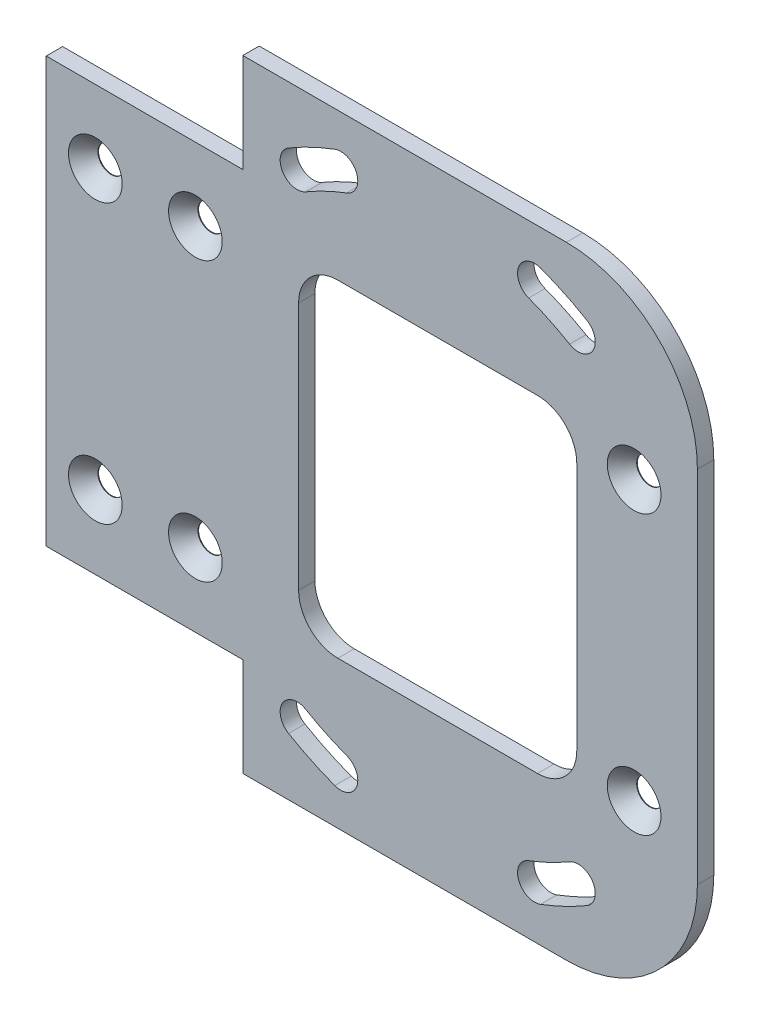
ISO-10303-21;
HEADER;
FILE_DESCRIPTION(('STEP AP214'),'2;1');
FILE_NAME('part.step','',(''),(''),'','','');
FILE_SCHEMA(('AUTOMOTIVE_DESIGN { 1 0 10303 214 1 1 1 1 }'));
ENDSEC;
DATA;
#1=APPLICATION_CONTEXT('core data for automotive mechanical design processes');
#2=APPLICATION_PROTOCOL_DEFINITION('international standard','automotive_design',2000,#1);
#3=PRODUCT_CONTEXT('',#1,'mechanical');
#4=PRODUCT('Part','Part','',(#3));
#5=PRODUCT_RELATED_PRODUCT_CATEGORY('part','',(#4));
#6=PRODUCT_DEFINITION_FORMATION('','',#4);
#7=PRODUCT_DEFINITION_CONTEXT('part definition',#1,'design');
#8=PRODUCT_DEFINITION('design','',#6,#7);
#9=PRODUCT_DEFINITION_SHAPE('','',#8);
#10=(LENGTH_UNIT() NAMED_UNIT(*) SI_UNIT(.MILLI.,.METRE.));
#11=(NAMED_UNIT(*) PLANE_ANGLE_UNIT() SI_UNIT($,.RADIAN.));
#12=(NAMED_UNIT(*) SI_UNIT($,.STERADIAN.) SOLID_ANGLE_UNIT());
#13=UNCERTAINTY_MEASURE_WITH_UNIT(LENGTH_MEASURE(1.E-05),#10,'distance_accuracy_value','');
#14=(GEOMETRIC_REPRESENTATION_CONTEXT(3) GLOBAL_UNCERTAINTY_ASSIGNED_CONTEXT((#13)) GLOBAL_UNIT_ASSIGNED_CONTEXT((#10,
#11,#12)) REPRESENTATION_CONTEXT('',''));
#15=CARTESIAN_POINT('',(0.,0.,0.));
#16=DIRECTION('',(0.,0.,1.));
#17=DIRECTION('',(1.,0.,0.));
#18=AXIS2_PLACEMENT_3D('',#15,#16,#17);
#19=CARTESIAN_POINT('',(50.3708613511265,60.2744681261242,3.175));
#20=DIRECTION('',(0.,0.,-1.));
#21=DIRECTION('',(-1.,0.,0.));
#22=AXIS2_PLACEMENT_3D('',#19,#20,#21);
#23=PLANE('',#22);
#24=DIRECTION('',(1.,0.,0.));
#25=VECTOR('',#24,1.);
#26=CARTESIAN_POINT('',(50.3708613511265,-60.3261241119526,3.175));
#27=LINE('',#26,#25);
#28=CARTESIAN_POINT('',(-37.787104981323,-60.3261241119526,3.175));
#29=VERTEX_POINT('',#28);
#30=CARTESIAN_POINT('',(24.9708613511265,-60.3261241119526,3.175));
#31=VERTEX_POINT('',#30);
#32=EDGE_CURVE('E422',#29,#31,#27,.T.);
#33=ORIENTED_EDGE('',*,*,#32,.T.);
#34=CARTESIAN_POINT('',(24.9708613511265,-34.9261241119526,3.175));
#35=DIRECTION('',(0.,0.,-1.));
#36=DIRECTION('',(-1.,0.,0.));
#37=AXIS2_PLACEMENT_3D('',#34,#35,#36);
#38=CIRCLE('',#37,25.4);
#39=CARTESIAN_POINT('',(50.3708613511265,-34.9261241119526,3.175));
#40=VERTEX_POINT('',#39);
#41=EDGE_CURVE('E517',#31,#40,#38,.F.);
#42=ORIENTED_EDGE('',*,*,#41,.T.);
#43=DIRECTION('',(0.,1.,0.));
#44=VECTOR('',#43,1.);
#45=CARTESIAN_POINT('',(50.3708613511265,-60.3261241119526,3.175));
#46=LINE('',#45,#44);
#47=CARTESIAN_POINT('',(50.3708613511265,34.8744681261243,3.175));
#48=VERTEX_POINT('',#47);
#49=EDGE_CURVE('E408',#40,#48,#46,.T.);
#50=ORIENTED_EDGE('',*,*,#49,.T.);
#51=CARTESIAN_POINT('',(24.9708613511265,34.8744681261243,3.175));
#52=DIRECTION('',(0.,0.,-1.));
#53=DIRECTION('',(-1.,0.,0.));
#54=AXIS2_PLACEMENT_3D('',#51,#52,#53);
#55=CIRCLE('',#54,25.4);
#56=CARTESIAN_POINT('',(24.9708613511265,60.2744681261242,3.175));
#57=VERTEX_POINT('',#56);
#58=EDGE_CURVE('E515',#48,#57,#55,.F.);
#59=ORIENTED_EDGE('',*,*,#58,.T.);
#60=DIRECTION('',(-1.,0.,0.));
#61=VECTOR('',#60,1.);
#62=CARTESIAN_POINT('',(-37.787104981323,60.2744681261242,3.175));
#63=LINE('',#62,#61);
#64=CARTESIAN_POINT('',(-37.787104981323,60.2744681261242,3.175));
#65=VERTEX_POINT('',#64);
#66=EDGE_CURVE('E445',#57,#65,#63,.T.);
#67=ORIENTED_EDGE('',*,*,#66,.T.);
#68=DIRECTION('',(0.,-1.,0.));
#69=VECTOR('',#68,1.);
#70=CARTESIAN_POINT('',(-37.787104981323,41.1157891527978,3.175));
#71=LINE('',#70,#69);
#72=CARTESIAN_POINT('',(-37.787104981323,41.1157891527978,3.175));
#73=VERTEX_POINT('',#72);
#74=EDGE_CURVE('E447',#65,#73,#71,.T.);
#75=ORIENTED_EDGE('',*,*,#74,.T.);
#76=DIRECTION('',(-1.,0.,0.));
#77=VECTOR('',#76,1.);
#78=CARTESIAN_POINT('',(-75.9206,41.1157891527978,3.175));
#79=LINE('',#78,#77);
#80=CARTESIAN_POINT('',(-75.9206,41.1157891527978,3.175));
#81=VERTEX_POINT('',#80);
#82=EDGE_CURVE('E450',#73,#81,#79,.T.);
#83=ORIENTED_EDGE('',*,*,#82,.T.);
#84=DIRECTION('',(0.,-1.,0.));
#85=VECTOR('',#84,1.);
#86=CARTESIAN_POINT('',(-75.9206,-41.2190298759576,3.175));
#87=LINE('',#86,#85);
#88=CARTESIAN_POINT('',(-75.9206,-41.2190298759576,3.175));
#89=VERTEX_POINT('',#88);
#90=EDGE_CURVE('E453',#81,#89,#87,.T.);
#91=ORIENTED_EDGE('',*,*,#90,.T.);
#92=DIRECTION('',(1.,0.,0.));
#93=VECTOR('',#92,1.);
#94=CARTESIAN_POINT('',(-75.9206,-41.2190298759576,3.175));
#95=LINE('',#94,#93);
#96=CARTESIAN_POINT('',(-37.787104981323,-41.2190298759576,3.175));
#97=VERTEX_POINT('',#96);
#98=EDGE_CURVE('E456',#89,#97,#95,.T.);
#99=ORIENTED_EDGE('',*,*,#98,.T.);
#100=DIRECTION('',(0.,-1.,0.));
#101=VECTOR('',#100,1.);
#102=CARTESIAN_POINT('',(-37.787104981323,-41.2190298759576,3.175));
#103=LINE('',#102,#101);
#104=EDGE_CURVE('E459',#97,#29,#103,.T.);
#105=ORIENTED_EDGE('',*,*,#104,.T.);
#106=EDGE_LOOP('',(#33,#42,#50,#59,#67,#75,#83,#91,#99,#105));
#107=FACE_BOUND('',#106,.T.);
#108=DIRECTION('',(0.,-1.,0.));
#109=VECTOR('',#108,1.);
#110=CARTESIAN_POINT('',(-26.9748,31.75,3.175));
#111=LINE('',#110,#109);
#112=CARTESIAN_POINT('',(-26.9748,24.13,3.175));
#113=VERTEX_POINT('',#112);
#114=CARTESIAN_POINT('',(-26.9748,-24.13,3.175));
#115=VERTEX_POINT('',#114);
#116=EDGE_CURVE('E411',#113,#115,#111,.T.);
#117=ORIENTED_EDGE('',*,*,#116,.F.);
#118=CARTESIAN_POINT('',(-19.3548,24.13,3.175));
#119=DIRECTION('',(0.,0.,-1.));
#120=DIRECTION('',(-1.,0.,0.));
#121=AXIS2_PLACEMENT_3D('',#118,#119,#120);
#122=CIRCLE('',#121,7.62);
#123=CARTESIAN_POINT('',(-19.3548,31.75,3.175));
#124=VERTEX_POINT('',#123);
#125=EDGE_CURVE('E504',#113,#124,#122,.T.);
#126=ORIENTED_EDGE('',*,*,#125,.T.);
#127=DIRECTION('',(-1.,0.,0.));
#128=VECTOR('',#127,1.);
#129=CARTESIAN_POINT('',(26.9748,31.75,3.175));
#130=LINE('',#129,#128);
#131=CARTESIAN_POINT('',(19.3548,31.75,3.175));
#132=VERTEX_POINT('',#131);
#133=EDGE_CURVE('E388',#132,#124,#130,.T.);
#134=ORIENTED_EDGE('',*,*,#133,.F.);
#135=CARTESIAN_POINT('',(19.3548,24.13,3.175));
#136=DIRECTION('',(0.,0.,-1.));
#137=DIRECTION('',(-1.,0.,0.));
#138=AXIS2_PLACEMENT_3D('',#135,#136,#137);
#139=CIRCLE('',#138,7.62);
#140=CARTESIAN_POINT('',(26.9748,24.13,3.175));
#141=VERTEX_POINT('',#140);
#142=EDGE_CURVE('E508',#132,#141,#139,.T.);
#143=ORIENTED_EDGE('',*,*,#142,.T.);
#144=DIRECTION('',(0.,1.,0.));
#145=VECTOR('',#144,1.);
#146=CARTESIAN_POINT('',(26.9748,-31.75,3.175));
#147=LINE('',#146,#145);
#148=CARTESIAN_POINT('',(26.9748,-24.13,3.175));
#149=VERTEX_POINT('',#148);
#150=EDGE_CURVE('E399',#149,#141,#147,.T.);
#151=ORIENTED_EDGE('',*,*,#150,.F.);
#152=CARTESIAN_POINT('',(19.3548,-24.13,3.175));
#153=DIRECTION('',(0.,0.,-1.));
#154=DIRECTION('',(-1.,0.,0.));
#155=AXIS2_PLACEMENT_3D('',#152,#153,#154);
#156=CIRCLE('',#155,7.62);
#157=CARTESIAN_POINT('',(19.3548,-31.75,3.175));
#158=VERTEX_POINT('',#157);
#159=EDGE_CURVE('E496',#149,#158,#156,.T.);
#160=ORIENTED_EDGE('',*,*,#159,.T.);
#161=DIRECTION('',(1.,0.,0.));
#162=VECTOR('',#161,1.);
#163=CARTESIAN_POINT('',(-26.9748,-31.75,3.175));
#164=LINE('',#163,#162);
#165=CARTESIAN_POINT('',(-19.3548,-31.75,3.175));
#166=VERTEX_POINT('',#165);
#167=EDGE_CURVE('E414',#166,#158,#164,.T.);
#168=ORIENTED_EDGE('',*,*,#167,.F.);
#169=CARTESIAN_POINT('',(-19.3548,-24.13,3.175));
#170=DIRECTION('',(0.,0.,-1.));
#171=DIRECTION('',(-1.,0.,0.));
#172=AXIS2_PLACEMENT_3D('',#169,#170,#171);
#173=CIRCLE('',#172,7.62);
#174=EDGE_CURVE('E500',#166,#115,#173,.T.);
#175=ORIENTED_EDGE('',*,*,#174,.T.);
#176=EDGE_LOOP('',(#117,#126,#134,#143,#151,#160,#168,#175));
#177=FACE_BOUND('',#176,.T.);
#178=CARTESIAN_POINT('',(-18.7977705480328,50.3439074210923,3.175));
#179=DIRECTION('',(0.,0.,1.));
#180=DIRECTION('',(1.,0.,0.));
#181=AXIS2_PLACEMENT_3D('',#178,#179,#180);
#182=CIRCLE('',#181,3.30199999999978);
#183=CARTESIAN_POINT('',(-17.6427360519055,47.2505113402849,3.175));
#184=VERTEX_POINT('',#183);
#185=CARTESIAN_POINT('',(-19.9528050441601,53.4373035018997,3.175));
#186=VERTEX_POINT('',#185);
#187=EDGE_CURVE('E378',#184,#186,#182,.T.);
#188=ORIENTED_EDGE('',*,*,#187,.F.);
#189=CARTESIAN_POINT('',(0.,1.42108555E-13,3.175));
#190=DIRECTION('',(0.,0.,-1.));
#191=DIRECTION('',(-1.,0.,0.));
#192=AXIS2_PLACEMENT_3D('',#189,#190,#191);
#193=CIRCLE('',#192,50.4368610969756);
#194=CARTESIAN_POINT('',(-25.5796684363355,43.4690409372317,3.175));
#195=VERTEX_POINT('',#194);
#196=EDGE_CURVE('E356',#195,#184,#193,.T.);
#197=ORIENTED_EDGE('',*,*,#196,.F.);
#198=CARTESIAN_POINT('',(-27.2543179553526,46.3148717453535,3.175));
#199=DIRECTION('',(0.,0.,1.));
#200=DIRECTION('',(1.,0.,0.));
#201=AXIS2_PLACEMENT_3D('',#198,#199,#200);
#202=CIRCLE('',#201,3.30199999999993);
#203=CARTESIAN_POINT('',(-28.9289674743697,49.1607025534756,3.175));
#204=VERTEX_POINT('',#203);
#205=EDGE_CURVE('E367',#204,#195,#202,.T.);
#206=ORIENTED_EDGE('',*,*,#205,.F.);
#207=CARTESIAN_POINT('',(0.,1.42108555E-13,3.175));
#208=DIRECTION('',(0.,0.,1.));
#209=DIRECTION('',(1.,0.,0.));
#210=AXIS2_PLACEMENT_3D('',#207,#208,#209);
#211=CIRCLE('',#210,57.0408610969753);
#212=EDGE_CURVE('E381',#186,#204,#211,.T.);
#213=ORIENTED_EDGE('',*,*,#212,.F.);
#214=EDGE_LOOP('',(#188,#197,#206,#213));
#215=FACE_BOUND('',#214,.T.);
#216=CARTESIAN_POINT('',(0.,1.42108555E-13,3.175));
#217=DIRECTION('',(0.,0.,1.));
#218=DIRECTION('',(1.,0.,0.));
#219=AXIS2_PLACEMENT_3D('',#216,#217,#218);
#220=CIRCLE('',#219,57.0408610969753);
#221=CARTESIAN_POINT('',(28.9289674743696,49.1607025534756,3.175));
#222=VERTEX_POINT('',#221);
#223=CARTESIAN_POINT('',(19.9528050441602,53.4373035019,3.175));
#224=VERTEX_POINT('',#223);
#225=EDGE_CURVE('E346',#222,#224,#220,.T.);
#226=ORIENTED_EDGE('',*,*,#225,.F.);
#227=CARTESIAN_POINT('',(27.2543179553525,46.3148717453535,3.175));
#228=DIRECTION('',(0.,0.,1.));
#229=DIRECTION('',(1.,0.,0.));
#230=AXIS2_PLACEMENT_3D('',#227,#228,#229);
#231=CIRCLE('',#230,3.3019999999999);
#232=CARTESIAN_POINT('',(25.5796684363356,43.4690409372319,3.175));
#233=VERTEX_POINT('',#232);
#234=EDGE_CURVE('E324',#233,#222,#231,.T.);
#235=ORIENTED_EDGE('',*,*,#234,.F.);
#236=CARTESIAN_POINT('',(0.,1.42108555E-13,3.175));
#237=DIRECTION('',(0.,0.,-1.));
#238=DIRECTION('',(-1.,0.,0.));
#239=AXIS2_PLACEMENT_3D('',#236,#237,#238);
#240=CIRCLE('',#239,50.4368610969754);
#241=CARTESIAN_POINT('',(17.6427360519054,47.2505113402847,3.175));
#242=VERTEX_POINT('',#241);
#243=EDGE_CURVE('E335',#242,#233,#240,.T.);
#244=ORIENTED_EDGE('',*,*,#243,.F.);
#245=CARTESIAN_POINT('',(18.7977705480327,50.3439074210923,3.175));
#246=DIRECTION('',(0.,0.,1.));
#247=DIRECTION('',(1.,0.,0.));
#248=AXIS2_PLACEMENT_3D('',#245,#246,#247);
#249=CIRCLE('',#248,3.30199999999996);
#250=EDGE_CURVE('E349',#224,#242,#249,.T.);
#251=ORIENTED_EDGE('',*,*,#250,.F.);
#252=EDGE_LOOP('',(#226,#235,#244,#251));
#253=FACE_BOUND('',#252,.T.);
#254=CARTESIAN_POINT('',(-18.7977705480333,-50.3439074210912,3.175));
#255=DIRECTION('',(0.,0.,1.));
#256=DIRECTION('',(1.,0.,0.));
#257=AXIS2_PLACEMENT_3D('',#254,#255,#256);
#258=CIRCLE('',#257,3.30200000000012);
#259=CARTESIAN_POINT('',(-19.9528050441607,-53.4373035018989,3.175));
#260=VERTEX_POINT('',#259);
#261=CARTESIAN_POINT('',(-17.6427360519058,-47.2505113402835,3.175));
#262=VERTEX_POINT('',#261);
#263=EDGE_CURVE('E314',#260,#262,#258,.T.);
#264=ORIENTED_EDGE('',*,*,#263,.F.);
#265=CARTESIAN_POINT('',(-2.57571748E-13,5.41788858E-13,3.175));
#266=DIRECTION('',(0.,0.,1.));
#267=DIRECTION('',(1.,0.,0.));
#268=AXIS2_PLACEMENT_3D('',#265,#266,#267);
#269=CIRCLE('',#268,57.0408610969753);
#270=CARTESIAN_POINT('',(-28.9289674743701,-49.1607025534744,3.175));
#271=VERTEX_POINT('',#270);
#272=EDGE_CURVE('E295',#271,#260,#269,.T.);
#273=ORIENTED_EDGE('',*,*,#272,.F.);
#274=CARTESIAN_POINT('',(-27.254317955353,-46.3148717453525,3.175));
#275=DIRECTION('',(0.,0.,1.));
#276=DIRECTION('',(1.,0.,0.));
#277=AXIS2_PLACEMENT_3D('',#274,#275,#276);
#278=CIRCLE('',#277,3.30200000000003);
#279=CARTESIAN_POINT('',(-25.5796684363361,-43.4690409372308,3.175));
#280=VERTEX_POINT('',#279);
#281=EDGE_CURVE('E303',#280,#271,#278,.T.);
#282=ORIENTED_EDGE('',*,*,#281,.F.);
#283=CARTESIAN_POINT('',(-2.57571748E-13,5.41788858E-13,3.175));
#284=DIRECTION('',(0.,0.,-1.));
#285=DIRECTION('',(-1.,0.,0.));
#286=AXIS2_PLACEMENT_3D('',#283,#284,#285);
#287=CIRCLE('',#286,50.4368610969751);
#288=EDGE_CURVE('E317',#262,#280,#287,.T.);
#289=ORIENTED_EDGE('',*,*,#288,.F.);
#290=EDGE_LOOP('',(#264,#273,#282,#289));
#291=FACE_BOUND('',#290,.T.);
#292=CARTESIAN_POINT('',(-2.57571748E-13,5.41788858E-13,3.175));
#293=DIRECTION('',(0.,0.,-1.));
#294=DIRECTION('',(-1.,0.,0.));
#295=AXIS2_PLACEMENT_3D('',#292,#293,#294);
#296=CIRCLE('',#295,57.0408610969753);
#297=CARTESIAN_POINT('',(28.9289674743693,-49.1607025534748,3.175));
#298=VERTEX_POINT('',#297);
#299=CARTESIAN_POINT('',(19.9528050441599,-53.4373035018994,3.175));
#300=VERTEX_POINT('',#299);
#301=EDGE_CURVE('E265',#298,#300,#296,.T.);
#302=ORIENTED_EDGE('',*,*,#301,.T.);
#303=CARTESIAN_POINT('',(18.7977705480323,-50.3439074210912,3.175));
#304=DIRECTION('',(0.,0.,-1.));
#305=DIRECTION('',(-1.,0.,0.));
#306=AXIS2_PLACEMENT_3D('',#303,#304,#305);
#307=CIRCLE('',#306,3.30199999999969);
#308=CARTESIAN_POINT('',(17.642736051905,-47.2505113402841,3.175));
#309=VERTEX_POINT('',#308);
#310=EDGE_CURVE('E257',#300,#309,#307,.T.);
#311=ORIENTED_EDGE('',*,*,#310,.T.);
#312=CARTESIAN_POINT('',(-2.57571748E-13,5.41788858E-13,3.175));
#313=DIRECTION('',(0.,0.,1.));
#314=DIRECTION('',(1.,0.,0.));
#315=AXIS2_PLACEMENT_3D('',#312,#313,#314);
#316=CIRCLE('',#315,50.4368610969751);
#317=CARTESIAN_POINT('',(25.5796684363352,-43.4690409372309,3.175));
#318=VERTEX_POINT('',#317);
#319=EDGE_CURVE('E269',#309,#318,#316,.T.);
#320=ORIENTED_EDGE('',*,*,#319,.T.);
#321=CARTESIAN_POINT('',(27.254317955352,-46.3148717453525,3.175));
#322=DIRECTION('',(0.,0.,-1.));
#323=DIRECTION('',(-1.,0.,0.));
#324=AXIS2_PLACEMENT_3D('',#321,#322,#323);
#325=CIRCLE('',#324,3.30200000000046);
#326=EDGE_CURVE('E273',#318,#298,#325,.T.);
#327=ORIENTED_EDGE('',*,*,#326,.T.);
#328=EDGE_LOOP('',(#302,#311,#320,#327));
#329=FACE_BOUND('',#328,.T.);
#330=CARTESIAN_POINT('',(38.1,-26.9875,3.175));
#331=DIRECTION('',(0.,0.,1.));
#332=DIRECTION('',(1.,0.,0.));
#333=AXIS2_PLACEMENT_3D('',#330,#331,#332);
#334=CIRCLE('',#333,5.207);
#335=CARTESIAN_POINT('',(43.307,-26.9875,3.175));
#336=VERTEX_POINT('',#335);
#337=EDGE_CURVE('E761',#336,#336,#334,.T.);
#338=ORIENTED_EDGE('',*,*,#337,.F.);
#339=EDGE_LOOP('',(#338));
#340=FACE_BOUND('',#339,.T.);
#341=CARTESIAN_POINT('',(38.1,26.9875,3.175));
#342=DIRECTION('',(0.,0.,1.));
#343=DIRECTION('',(1.,0.,0.));
#344=AXIS2_PLACEMENT_3D('',#341,#342,#343);
#345=CIRCLE('',#344,5.207);
#346=CARTESIAN_POINT('',(43.307,26.9875,3.175));
#347=VERTEX_POINT('',#346);
#348=EDGE_CURVE('E752',#347,#347,#345,.T.);
#349=ORIENTED_EDGE('',*,*,#348,.F.);
#350=EDGE_LOOP('',(#349));
#351=FACE_BOUND('',#350,.T.);
#352=CARTESIAN_POINT('',(-66.3956,-26.9875,3.175));
#353=DIRECTION('',(0.,0.,1.));
#354=DIRECTION('',(1.,0.,0.));
#355=AXIS2_PLACEMENT_3D('',#352,#353,#354);
#356=CIRCLE('',#355,5.207);
#357=CARTESIAN_POINT('',(-61.1886,-26.9875,3.175));
#358=VERTEX_POINT('',#357);
#359=EDGE_CURVE('E743',#358,#358,#356,.T.);
#360=ORIENTED_EDGE('',*,*,#359,.F.);
#361=EDGE_LOOP('',(#360));
#362=FACE_BOUND('',#361,.T.);
#363=CARTESIAN_POINT('',(-46.99,-26.9875,3.175));
#364=DIRECTION('',(0.,0.,1.));
#365=DIRECTION('',(1.,0.,0.));
#366=AXIS2_PLACEMENT_3D('',#363,#364,#365);
#367=CIRCLE('',#366,5.207);
#368=CARTESIAN_POINT('',(-41.783,-26.9875,3.175));
#369=VERTEX_POINT('',#368);
#370=EDGE_CURVE('E734',#369,#369,#367,.T.);
#371=ORIENTED_EDGE('',*,*,#370,.F.);
#372=EDGE_LOOP('',(#371));
#373=FACE_BOUND('',#372,.T.);
#374=CARTESIAN_POINT('',(-66.3956,26.9875,3.175));
#375=DIRECTION('',(0.,0.,1.));
#376=DIRECTION('',(1.,0.,0.));
#377=AXIS2_PLACEMENT_3D('',#374,#375,#376);
#378=CIRCLE('',#377,5.207);
#379=CARTESIAN_POINT('',(-61.1886,26.9875,3.175));
#380=VERTEX_POINT('',#379);
#381=EDGE_CURVE('E725',#380,#380,#378,.T.);
#382=ORIENTED_EDGE('',*,*,#381,.F.);
#383=EDGE_LOOP('',(#382));
#384=FACE_BOUND('',#383,.T.);
#385=CARTESIAN_POINT('',(-46.99,26.9875,3.175));
#386=DIRECTION('',(0.,0.,1.));
#387=DIRECTION('',(1.,0.,0.));
#388=AXIS2_PLACEMENT_3D('',#385,#386,#387);
#389=CIRCLE('',#388,5.207);
#390=CARTESIAN_POINT('',(-41.783,26.9875,3.175));
#391=VERTEX_POINT('',#390);
#392=EDGE_CURVE('E717',#391,#391,#389,.T.);
#393=ORIENTED_EDGE('',*,*,#392,.F.);
#394=EDGE_LOOP('',(#393));
#395=FACE_BOUND('',#394,.T.);
#396=ADVANCED_FACE('F32',(#107,#177,#215,#253,#291,#329,#340,#351,#362,#373,#384,#395),#23,.F.);
#397=CARTESIAN_POINT('',(50.3708613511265,-60.3261241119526,0.));
#398=DIRECTION('',(1.,0.,0.));
#399=DIRECTION('',(0.,0.,-1.));
#400=AXIS2_PLACEMENT_3D('',#397,#398,#399);
#401=PLANE('',#400);
#402=ORIENTED_EDGE('',*,*,#49,.F.);
#403=DIRECTION('',(0.,0.,1.));
#404=VECTOR('',#403,1.);
#405=CARTESIAN_POINT('',(50.3708613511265,-34.9261241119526,0.));
#406=LINE('',#405,#404);
#407=CARTESIAN_POINT('',(50.3708613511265,-34.9261241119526,0.));
#408=VERTEX_POINT('',#407);
#409=EDGE_CURVE('E522',#40,#408,#406,.F.);
#410=ORIENTED_EDGE('',*,*,#409,.T.);
#411=DIRECTION('',(0.,1.,0.));
#412=VECTOR('',#411,1.);
#413=CARTESIAN_POINT('',(50.3708613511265,-60.3261241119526,0.));
#414=LINE('',#413,#412);
#415=CARTESIAN_POINT('',(50.3708613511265,34.8744681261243,0.));
#416=VERTEX_POINT('',#415);
#417=EDGE_CURVE('E419',#408,#416,#414,.T.);
#418=ORIENTED_EDGE('',*,*,#417,.T.);
#419=DIRECTION('',(0.,0.,1.));
#420=VECTOR('',#419,1.);
#421=CARTESIAN_POINT('',(50.3708613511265,34.8744681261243,0.));
#422=LINE('',#421,#420);
#423=EDGE_CURVE('E519',#416,#48,#422,.T.);
#424=ORIENTED_EDGE('',*,*,#423,.T.);
#425=EDGE_LOOP('',(#402,#410,#418,#424));
#426=FACE_BOUND('',#425,.T.);
#427=ADVANCED_FACE('F539',(#426),#401,.T.);
#428=CARTESIAN_POINT('',(50.3708613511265,-60.3261241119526,0.));
#429=DIRECTION('',(0.,-1.,0.));
#430=DIRECTION('',(0.,0.,-1.));
#431=AXIS2_PLACEMENT_3D('',#428,#429,#430);
#432=PLANE('',#431);
#433=DIRECTION('',(1.,0.,0.));
#434=VECTOR('',#433,1.);
#435=CARTESIAN_POINT('',(50.3708613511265,-60.3261241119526,0.));
#436=LINE('',#435,#434);
#437=CARTESIAN_POINT('',(-37.787104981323,-60.3261241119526,0.));
#438=VERTEX_POINT('',#437);
#439=CARTESIAN_POINT('',(24.9708613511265,-60.3261241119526,0.));
#440=VERTEX_POINT('',#439);
#441=EDGE_CURVE('E439',#438,#440,#436,.T.);
#442=ORIENTED_EDGE('',*,*,#441,.T.);
#443=DIRECTION('',(0.,0.,1.));
#444=VECTOR('',#443,1.);
#445=CARTESIAN_POINT('',(24.9708613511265,-60.3261241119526,0.));
#446=LINE('',#445,#444);
#447=EDGE_CURVE('E512',#440,#31,#446,.T.);
#448=ORIENTED_EDGE('',*,*,#447,.T.);
#449=ORIENTED_EDGE('',*,*,#32,.F.);
#450=DIRECTION('',(0.,0.,1.));
#451=VECTOR('',#450,1.);
#452=CARTESIAN_POINT('',(-37.787104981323,-60.3261241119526,0.));
#453=LINE('',#452,#451);
#454=EDGE_CURVE('E464',#438,#29,#453,.T.);
#455=ORIENTED_EDGE('',*,*,#454,.F.);
#456=EDGE_LOOP('',(#442,#448,#449,#455));
#457=FACE_BOUND('',#456,.T.);
#458=ADVANCED_FACE('F532',(#457),#432,.T.);
#459=CARTESIAN_POINT('',(-37.787104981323,-41.2190298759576,0.));
#460=DIRECTION('',(-1.,0.,0.));
#461=DIRECTION('',(0.,0.,1.));
#462=AXIS2_PLACEMENT_3D('',#459,#460,#461);
#463=PLANE('',#462);
#464=ORIENTED_EDGE('',*,*,#104,.F.);
#465=DIRECTION('',(0.,0.,1.));
#466=VECTOR('',#465,1.);
#467=CARTESIAN_POINT('',(-37.787104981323,-41.2190298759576,0.));
#468=LINE('',#467,#466);
#469=CARTESIAN_POINT('',(-37.787104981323,-41.2190298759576,0.));
#470=VERTEX_POINT('',#469);
#471=EDGE_CURVE('E467',#470,#97,#468,.T.);
#472=ORIENTED_EDGE('',*,*,#471,.F.);
#473=DIRECTION('',(0.,-1.,0.));
#474=VECTOR('',#473,1.);
#475=CARTESIAN_POINT('',(-37.787104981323,-41.2190298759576,0.));
#476=LINE('',#475,#474);
#477=EDGE_CURVE('E436',#470,#438,#476,.T.);
#478=ORIENTED_EDGE('',*,*,#477,.T.);
#479=ORIENTED_EDGE('',*,*,#454,.T.);
#480=EDGE_LOOP('',(#464,#472,#478,#479));
#481=FACE_BOUND('',#480,.T.);
#482=ADVANCED_FACE('F562',(#481),#463,.T.);
#483=CARTESIAN_POINT('',(-75.9206,-41.2190298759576,0.));
#484=DIRECTION('',(0.,-1.,0.));
#485=DIRECTION('',(0.,0.,-1.));
#486=AXIS2_PLACEMENT_3D('',#483,#484,#485);
#487=PLANE('',#486);
#488=ORIENTED_EDGE('',*,*,#98,.F.);
#489=DIRECTION('',(0.,0.,1.));
#490=VECTOR('',#489,1.);
#491=CARTESIAN_POINT('',(-75.9206,-41.2190298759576,0.));
#492=LINE('',#491,#490);
#493=CARTESIAN_POINT('',(-75.9206,-41.2190298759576,0.));
#494=VERTEX_POINT('',#493);
#495=EDGE_CURVE('E469',#494,#89,#492,.T.);
#496=ORIENTED_EDGE('',*,*,#495,.F.);
#497=DIRECTION('',(1.,0.,0.));
#498=VECTOR('',#497,1.);
#499=CARTESIAN_POINT('',(-75.9206,-41.2190298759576,0.));
#500=LINE('',#499,#498);
#501=EDGE_CURVE('E433',#494,#470,#500,.T.);
#502=ORIENTED_EDGE('',*,*,#501,.T.);
#503=ORIENTED_EDGE('',*,*,#471,.T.);
#504=EDGE_LOOP('',(#488,#496,#502,#503));
#505=FACE_BOUND('',#504,.T.);
#506=ADVANCED_FACE('F559',(#505),#487,.T.);
#507=CARTESIAN_POINT('',(-75.9206,-41.2190298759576,0.));
#508=DIRECTION('',(-1.,0.,0.));
#509=DIRECTION('',(0.,0.,1.));
#510=AXIS2_PLACEMENT_3D('',#507,#508,#509);
#511=PLANE('',#510);
#512=ORIENTED_EDGE('',*,*,#90,.F.);
#513=DIRECTION('',(0.,0.,1.));
#514=VECTOR('',#513,1.);
#515=CARTESIAN_POINT('',(-75.9206,41.1157891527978,0.));
#516=LINE('',#515,#514);
#517=CARTESIAN_POINT('',(-75.9206,41.1157891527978,0.));
#518=VERTEX_POINT('',#517);
#519=EDGE_CURVE('E471',#518,#81,#516,.T.);
#520=ORIENTED_EDGE('',*,*,#519,.F.);
#521=DIRECTION('',(0.,-1.,0.));
#522=VECTOR('',#521,1.);
#523=CARTESIAN_POINT('',(-75.9206,-41.2190298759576,0.));
#524=LINE('',#523,#522);
#525=EDGE_CURVE('E430',#518,#494,#524,.T.);
#526=ORIENTED_EDGE('',*,*,#525,.T.);
#527=ORIENTED_EDGE('',*,*,#495,.T.);
#528=EDGE_LOOP('',(#512,#520,#526,#527));
#529=FACE_BOUND('',#528,.T.);
#530=ADVANCED_FACE('F555',(#529),#511,.T.);
#531=CARTESIAN_POINT('',(-75.9206,41.1157891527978,0.));
#532=DIRECTION('',(0.,1.,0.));
#533=DIRECTION('',(0.,0.,1.));
#534=AXIS2_PLACEMENT_3D('',#531,#532,#533);
#535=PLANE('',#534);
#536=ORIENTED_EDGE('',*,*,#82,.F.);
#537=DIRECTION('',(0.,0.,1.));
#538=VECTOR('',#537,1.);
#539=CARTESIAN_POINT('',(-37.787104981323,41.1157891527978,0.));
#540=LINE('',#539,#538);
#541=CARTESIAN_POINT('',(-37.787104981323,41.1157891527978,0.));
#542=VERTEX_POINT('',#541);
#543=EDGE_CURVE('E473',#542,#73,#540,.T.);
#544=ORIENTED_EDGE('',*,*,#543,.F.);
#545=DIRECTION('',(-1.,0.,0.));
#546=VECTOR('',#545,1.);
#547=CARTESIAN_POINT('',(-75.9206,41.1157891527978,0.));
#548=LINE('',#547,#546);
#549=EDGE_CURVE('E427',#542,#518,#548,.T.);
#550=ORIENTED_EDGE('',*,*,#549,.T.);
#551=ORIENTED_EDGE('',*,*,#519,.T.);
#552=EDGE_LOOP('',(#536,#544,#550,#551));
#553=FACE_BOUND('',#552,.T.);
#554=ADVANCED_FACE('F551',(#553),#535,.T.);
#555=CARTESIAN_POINT('',(-37.787104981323,41.1157891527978,0.));
#556=DIRECTION('',(-1.,0.,0.));
#557=DIRECTION('',(0.,0.,1.));
#558=AXIS2_PLACEMENT_3D('',#555,#556,#557);
#559=PLANE('',#558);
#560=ORIENTED_EDGE('',*,*,#74,.F.);
#561=DIRECTION('',(0.,0.,1.));
#562=VECTOR('',#561,1.);
#563=CARTESIAN_POINT('',(-37.787104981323,60.2744681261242,0.));
#564=LINE('',#563,#562);
#565=CARTESIAN_POINT('',(-37.787104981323,60.2744681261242,0.));
#566=VERTEX_POINT('',#565);
#567=EDGE_CURVE('E442',#566,#65,#564,.T.);
#568=ORIENTED_EDGE('',*,*,#567,.F.);
#569=DIRECTION('',(0.,-1.,0.));
#570=VECTOR('',#569,1.);
#571=CARTESIAN_POINT('',(-37.787104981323,41.1157891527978,0.));
#572=LINE('',#571,#570);
#573=EDGE_CURVE('E424',#566,#542,#572,.T.);
#574=ORIENTED_EDGE('',*,*,#573,.T.);
#575=ORIENTED_EDGE('',*,*,#543,.T.);
#576=EDGE_LOOP('',(#560,#568,#574,#575));
#577=FACE_BOUND('',#576,.T.);
#578=ADVANCED_FACE('F547',(#577),#559,.T.);
#579=CARTESIAN_POINT('',(-37.787104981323,60.2744681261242,0.));
#580=DIRECTION('',(0.,1.,0.));
#581=DIRECTION('',(0.,0.,1.));
#582=AXIS2_PLACEMENT_3D('',#579,#580,#581);
#583=PLANE('',#582);
#584=ORIENTED_EDGE('',*,*,#66,.F.);
#585=DIRECTION('',(0.,0.,1.));
#586=VECTOR('',#585,1.);
#587=CARTESIAN_POINT('',(24.9708613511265,60.2744681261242,0.));
#588=LINE('',#587,#586);
#589=CARTESIAN_POINT('',(24.9708613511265,60.2744681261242,0.));
#590=VERTEX_POINT('',#589);
#591=EDGE_CURVE('E11',#57,#590,#588,.F.);
#592=ORIENTED_EDGE('',*,*,#591,.T.);
#593=DIRECTION('',(-1.,0.,0.));
#594=VECTOR('',#593,1.);
#595=CARTESIAN_POINT('',(-37.787104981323,60.2744681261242,0.));
#596=LINE('',#595,#594);
#597=EDGE_CURVE('E421',#590,#566,#596,.T.);
#598=ORIENTED_EDGE('',*,*,#597,.T.);
#599=ORIENTED_EDGE('',*,*,#567,.T.);
#600=EDGE_LOOP('',(#584,#592,#598,#599));
#601=FACE_BOUND('',#600,.T.);
#602=ADVANCED_FACE('F542',(#601),#583,.T.);
#603=CARTESIAN_POINT('',(50.3708613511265,60.2744681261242,0.));
#604=DIRECTION('',(0.,0.,-1.));
#605=DIRECTION('',(-1.,0.,0.));
#606=AXIS2_PLACEMENT_3D('',#603,#604,#605);
#607=PLANE('',#606);
#608=CARTESIAN_POINT('',(-46.99,26.9875,0.));
#609=DIRECTION('',(0.,0.,1.));
#610=DIRECTION('',(1.,0.,0.));
#611=AXIS2_PLACEMENT_3D('',#608,#609,#610);
#612=CIRCLE('',#611,2.55270000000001);
#613=CARTESIAN_POINT('',(-44.4373,26.9875,0.));
#614=VERTEX_POINT('',#613);
#615=EDGE_CURVE('E720',#614,#614,#612,.T.);
#616=ORIENTED_EDGE('',*,*,#615,.T.);
#617=EDGE_LOOP('',(#616));
#618=FACE_BOUND('',#617,.T.);
#619=CARTESIAN_POINT('',(-66.3956,26.9875,0.));
#620=DIRECTION('',(0.,0.,1.));
#621=DIRECTION('',(1.,0.,0.));
#622=AXIS2_PLACEMENT_3D('',#619,#620,#621);
#623=CIRCLE('',#622,2.55270000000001);
#624=CARTESIAN_POINT('',(-63.8429,26.9875,0.));
#625=VERTEX_POINT('',#624);
#626=EDGE_CURVE('E731',#625,#625,#623,.T.);
#627=ORIENTED_EDGE('',*,*,#626,.T.);
#628=EDGE_LOOP('',(#627));
#629=FACE_BOUND('',#628,.T.);
#630=CARTESIAN_POINT('',(-46.99,-26.9875,0.));
#631=DIRECTION('',(0.,0.,1.));
#632=DIRECTION('',(1.,0.,0.));
#633=AXIS2_PLACEMENT_3D('',#630,#631,#632);
#634=CIRCLE('',#633,2.55270000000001);
#635=CARTESIAN_POINT('',(-44.4373,-26.9875,0.));
#636=VERTEX_POINT('',#635);
#637=EDGE_CURVE('E740',#636,#636,#634,.T.);
#638=ORIENTED_EDGE('',*,*,#637,.T.);
#639=EDGE_LOOP('',(#638));
#640=FACE_BOUND('',#639,.T.);
#641=CARTESIAN_POINT('',(-66.3956,-26.9875,0.));
#642=DIRECTION('',(0.,0.,1.));
#643=DIRECTION('',(1.,0.,0.));
#644=AXIS2_PLACEMENT_3D('',#641,#642,#643);
#645=CIRCLE('',#644,2.55270000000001);
#646=CARTESIAN_POINT('',(-63.8429,-26.9875,0.));
#647=VERTEX_POINT('',#646);
#648=EDGE_CURVE('E749',#647,#647,#645,.T.);
#649=ORIENTED_EDGE('',*,*,#648,.T.);
#650=EDGE_LOOP('',(#649));
#651=FACE_BOUND('',#650,.T.);
#652=CARTESIAN_POINT('',(38.1,26.9875,0.));
#653=DIRECTION('',(0.,0.,1.));
#654=DIRECTION('',(1.,0.,0.));
#655=AXIS2_PLACEMENT_3D('',#652,#653,#654);
#656=CIRCLE('',#655,2.55270000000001);
#657=CARTESIAN_POINT('',(40.6527,26.9875,0.));
#658=VERTEX_POINT('',#657);
#659=EDGE_CURVE('E758',#658,#658,#656,.T.);
#660=ORIENTED_EDGE('',*,*,#659,.T.);
#661=EDGE_LOOP('',(#660));
#662=FACE_BOUND('',#661,.T.);
#663=CARTESIAN_POINT('',(38.1,-26.9875,0.));
#664=DIRECTION('',(0.,0.,1.));
#665=DIRECTION('',(1.,0.,0.));
#666=AXIS2_PLACEMENT_3D('',#663,#664,#665);
#667=CIRCLE('',#666,2.55270000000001);
#668=CARTESIAN_POINT('',(40.6527,-26.9875,0.));
#669=VERTEX_POINT('',#668);
#670=EDGE_CURVE('E283',#669,#669,#667,.T.);
#671=ORIENTED_EDGE('',*,*,#670,.T.);
#672=EDGE_LOOP('',(#671));
#673=FACE_BOUND('',#672,.T.);
#674=CARTESIAN_POINT('',(18.7977705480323,-50.3439074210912,0.));
#675=DIRECTION('',(0.,0.,-1.));
#676=DIRECTION('',(-1.,0.,0.));
#677=AXIS2_PLACEMENT_3D('',#674,#675,#676);
#678=CIRCLE('',#677,3.30199999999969);
#679=CARTESIAN_POINT('',(19.9528050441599,-53.4373035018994,0.));
#680=VERTEX_POINT('',#679);
#681=CARTESIAN_POINT('',(17.642736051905,-47.2505113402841,0.));
#682=VERTEX_POINT('',#681);
#683=EDGE_CURVE('E260',#680,#682,#678,.T.);
#684=ORIENTED_EDGE('',*,*,#683,.F.);
#685=CARTESIAN_POINT('',(-2.57571748E-13,5.41788858E-13,0.));
#686=DIRECTION('',(0.,0.,-1.));
#687=DIRECTION('',(-1.,0.,0.));
#688=AXIS2_PLACEMENT_3D('',#685,#686,#687);
#689=CIRCLE('',#688,57.0408610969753);
#690=CARTESIAN_POINT('',(28.9289674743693,-49.1607025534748,0.));
#691=VERTEX_POINT('',#690);
#692=EDGE_CURVE('E277',#691,#680,#689,.T.);
#693=ORIENTED_EDGE('',*,*,#692,.F.);
#694=CARTESIAN_POINT('',(27.254317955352,-46.3148717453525,0.));
#695=DIRECTION('',(0.,0.,-1.));
#696=DIRECTION('',(-1.,0.,0.));
#697=AXIS2_PLACEMENT_3D('',#694,#695,#696);
#698=CIRCLE('',#697,3.30200000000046);
#699=CARTESIAN_POINT('',(25.5796684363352,-43.4690409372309,0.));
#700=VERTEX_POINT('',#699);
#701=EDGE_CURVE('E280',#700,#691,#698,.T.);
#702=ORIENTED_EDGE('',*,*,#701,.F.);
#703=CARTESIAN_POINT('',(-2.57571748E-13,5.41788858E-13,0.));
#704=DIRECTION('',(0.,0.,1.));
#705=DIRECTION('',(1.,0.,0.));
#706=AXIS2_PLACEMENT_3D('',#703,#704,#705);
#707=CIRCLE('',#706,50.4368610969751);
#708=EDGE_CURVE('E289',#682,#700,#707,.T.);
#709=ORIENTED_EDGE('',*,*,#708,.F.);
#710=EDGE_LOOP('',(#684,#693,#702,#709));
#711=FACE_BOUND('',#710,.T.);
#712=CARTESIAN_POINT('',(-2.57571748E-13,5.41788858E-13,0.));
#713=DIRECTION('',(0.,0.,1.));
#714=DIRECTION('',(1.,0.,0.));
#715=AXIS2_PLACEMENT_3D('',#712,#713,#714);
#716=CIRCLE('',#715,57.0408610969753);
#717=CARTESIAN_POINT('',(-28.9289674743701,-49.1607025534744,0.));
#718=VERTEX_POINT('',#717);
#719=CARTESIAN_POINT('',(-19.9528050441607,-53.4373035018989,0.));
#720=VERTEX_POINT('',#719);
#721=EDGE_CURVE('E299',#718,#720,#716,.T.);
#722=ORIENTED_EDGE('',*,*,#721,.T.);
#723=CARTESIAN_POINT('',(-18.7977705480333,-50.3439074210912,0.));
#724=DIRECTION('',(0.,0.,1.));
#725=DIRECTION('',(1.,0.,0.));
#726=AXIS2_PLACEMENT_3D('',#723,#724,#725);
#727=CIRCLE('',#726,3.30200000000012);
#728=CARTESIAN_POINT('',(-17.6427360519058,-47.2505113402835,0.));
#729=VERTEX_POINT('',#728);
#730=EDGE_CURVE('E302',#720,#729,#727,.T.);
#731=ORIENTED_EDGE('',*,*,#730,.T.);
#732=CARTESIAN_POINT('',(-2.57571748E-13,5.41788858E-13,0.));
#733=DIRECTION('',(0.,0.,-1.));
#734=DIRECTION('',(-1.,0.,0.));
#735=AXIS2_PLACEMENT_3D('',#732,#733,#734);
#736=CIRCLE('',#735,50.4368610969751);
#737=CARTESIAN_POINT('',(-25.5796684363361,-43.4690409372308,0.));
#738=VERTEX_POINT('',#737);
#739=EDGE_CURVE('E306',#729,#738,#736,.T.);
#740=ORIENTED_EDGE('',*,*,#739,.T.);
#741=CARTESIAN_POINT('',(-27.254317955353,-46.3148717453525,0.));
#742=DIRECTION('',(0.,0.,1.));
#743=DIRECTION('',(1.,0.,0.));
#744=AXIS2_PLACEMENT_3D('',#741,#742,#743);
#745=CIRCLE('',#744,3.30200000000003);
#746=EDGE_CURVE('E309',#738,#718,#745,.T.);
#747=ORIENTED_EDGE('',*,*,#746,.T.);
#748=EDGE_LOOP('',(#722,#731,#740,#747));
#749=FACE_BOUND('',#748,.T.);
#750=CARTESIAN_POINT('',(27.2543179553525,46.3148717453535,0.));
#751=DIRECTION('',(0.,0.,1.));
#752=DIRECTION('',(1.,0.,0.));
#753=AXIS2_PLACEMENT_3D('',#750,#751,#752);
#754=CIRCLE('',#753,3.3019999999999);
#755=CARTESIAN_POINT('',(25.5796684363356,43.4690409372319,0.));
#756=VERTEX_POINT('',#755);
#757=CARTESIAN_POINT('',(28.9289674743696,49.1607025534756,0.));
#758=VERTEX_POINT('',#757);
#759=EDGE_CURVE('E331',#756,#758,#754,.T.);
#760=ORIENTED_EDGE('',*,*,#759,.T.);
#761=CARTESIAN_POINT('',(0.,1.42108555E-13,0.));
#762=DIRECTION('',(0.,0.,1.));
#763=DIRECTION('',(1.,0.,0.));
#764=AXIS2_PLACEMENT_3D('',#761,#762,#763);
#765=CIRCLE('',#764,57.0408610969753);
#766=CARTESIAN_POINT('',(19.9528050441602,53.4373035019,0.));
#767=VERTEX_POINT('',#766);
#768=EDGE_CURVE('E334',#758,#767,#765,.T.);
#769=ORIENTED_EDGE('',*,*,#768,.T.);
#770=CARTESIAN_POINT('',(18.7977705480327,50.3439074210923,0.));
#771=DIRECTION('',(0.,0.,1.));
#772=DIRECTION('',(1.,0.,0.));
#773=AXIS2_PLACEMENT_3D('',#770,#771,#772);
#774=CIRCLE('',#773,3.30199999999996);
#775=CARTESIAN_POINT('',(17.6427360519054,47.2505113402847,0.));
#776=VERTEX_POINT('',#775);
#777=EDGE_CURVE('E338',#767,#776,#774,.T.);
#778=ORIENTED_EDGE('',*,*,#777,.T.);
#779=CARTESIAN_POINT('',(0.,1.42108555E-13,0.));
#780=DIRECTION('',(0.,0.,-1.));
#781=DIRECTION('',(-1.,0.,0.));
#782=AXIS2_PLACEMENT_3D('',#779,#780,#781);
#783=CIRCLE('',#782,50.4368610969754);
#784=EDGE_CURVE('E341',#776,#756,#783,.T.);
#785=ORIENTED_EDGE('',*,*,#784,.T.);
#786=EDGE_LOOP('',(#760,#769,#778,#785));
#787=FACE_BOUND('',#786,.T.);
#788=CARTESIAN_POINT('',(0.,1.42108555E-13,0.));
#789=DIRECTION('',(0.,0.,-1.));
#790=DIRECTION('',(-1.,0.,0.));
#791=AXIS2_PLACEMENT_3D('',#788,#789,#790);
#792=CIRCLE('',#791,50.4368610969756);
#793=CARTESIAN_POINT('',(-25.5796684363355,43.4690409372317,0.));
#794=VERTEX_POINT('',#793);
#795=CARTESIAN_POINT('',(-17.6427360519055,47.2505113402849,0.));
#796=VERTEX_POINT('',#795);
#797=EDGE_CURVE('E363',#794,#796,#792,.T.);
#798=ORIENTED_EDGE('',*,*,#797,.T.);
#799=CARTESIAN_POINT('',(-18.7977705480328,50.3439074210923,0.));
#800=DIRECTION('',(0.,0.,1.));
#801=DIRECTION('',(1.,0.,0.));
#802=AXIS2_PLACEMENT_3D('',#799,#800,#801);
#803=CIRCLE('',#802,3.30199999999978);
#804=CARTESIAN_POINT('',(-19.9528050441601,53.4373035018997,0.));
#805=VERTEX_POINT('',#804);
#806=EDGE_CURVE('E366',#796,#805,#803,.T.);
#807=ORIENTED_EDGE('',*,*,#806,.T.);
#808=CARTESIAN_POINT('',(0.,1.42108555E-13,0.));
#809=DIRECTION('',(0.,0.,1.));
#810=DIRECTION('',(1.,0.,0.));
#811=AXIS2_PLACEMENT_3D('',#808,#809,#810);
#812=CIRCLE('',#811,57.0408610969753);
#813=CARTESIAN_POINT('',(-28.9289674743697,49.1607025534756,0.));
#814=VERTEX_POINT('',#813);
#815=EDGE_CURVE('E370',#805,#814,#812,.T.);
#816=ORIENTED_EDGE('',*,*,#815,.T.);
#817=CARTESIAN_POINT('',(-27.2543179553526,46.3148717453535,0.));
#818=DIRECTION('',(0.,0.,1.));
#819=DIRECTION('',(1.,0.,0.));
#820=AXIS2_PLACEMENT_3D('',#817,#818,#819);
#821=CIRCLE('',#820,3.30199999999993);
#822=EDGE_CURVE('E373',#814,#794,#821,.T.);
#823=ORIENTED_EDGE('',*,*,#822,.T.);
#824=EDGE_LOOP('',(#798,#807,#816,#823));
#825=FACE_BOUND('',#824,.T.);
#826=DIRECTION('',(0.,1.,0.));
#827=VECTOR('',#826,1.);
#828=CARTESIAN_POINT('',(26.9748,-31.75,0.));
#829=LINE('',#828,#827);
#830=CARTESIAN_POINT('',(26.9748,-24.13,0.));
#831=VERTEX_POINT('',#830);
#832=CARTESIAN_POINT('',(26.9748,24.13,0.));
#833=VERTEX_POINT('',#832);
#834=EDGE_CURVE('E405',#831,#833,#829,.T.);
#835=ORIENTED_EDGE('',*,*,#834,.T.);
#836=CARTESIAN_POINT('',(19.3548,24.13,0.));
#837=DIRECTION('',(0.,0.,-1.));
#838=DIRECTION('',(-1.,0.,0.));
#839=AXIS2_PLACEMENT_3D('',#836,#837,#838);
#840=CIRCLE('',#839,7.62);
#841=CARTESIAN_POINT('',(19.3548,31.75,0.));
#842=VERTEX_POINT('',#841);
#843=EDGE_CURVE('E510',#833,#842,#840,.F.);
#844=ORIENTED_EDGE('',*,*,#843,.T.);
#845=DIRECTION('',(-1.,0.,0.));
#846=VECTOR('',#845,1.);
#847=CARTESIAN_POINT('',(26.9748,31.75,0.));
#848=LINE('',#847,#846);
#849=CARTESIAN_POINT('',(-19.3548,31.75,0.));
#850=VERTEX_POINT('',#849);
#851=EDGE_CURVE('E395',#842,#850,#848,.T.);
#852=ORIENTED_EDGE('',*,*,#851,.T.);
#853=CARTESIAN_POINT('',(-19.3548,24.13,0.));
#854=DIRECTION('',(0.,0.,-1.));
#855=DIRECTION('',(-1.,0.,0.));
#856=AXIS2_PLACEMENT_3D('',#853,#854,#855);
#857=CIRCLE('',#856,7.62);
#858=CARTESIAN_POINT('',(-26.9748,24.13,0.));
#859=VERTEX_POINT('',#858);
#860=EDGE_CURVE('E506',#850,#859,#857,.F.);
#861=ORIENTED_EDGE('',*,*,#860,.T.);
#862=DIRECTION('',(0.,-1.,0.));
#863=VECTOR('',#862,1.);
#864=CARTESIAN_POINT('',(-26.9748,31.75,0.));
#865=LINE('',#864,#863);
#866=CARTESIAN_POINT('',(-26.9748,-24.13,0.));
#867=VERTEX_POINT('',#866);
#868=EDGE_CURVE('E398',#859,#867,#865,.T.);
#869=ORIENTED_EDGE('',*,*,#868,.T.);
#870=CARTESIAN_POINT('',(-19.3548,-24.13,0.));
#871=DIRECTION('',(0.,0.,-1.));
#872=DIRECTION('',(-1.,0.,0.));
#873=AXIS2_PLACEMENT_3D('',#870,#871,#872);
#874=CIRCLE('',#873,7.62);
#875=CARTESIAN_POINT('',(-19.3548,-31.75,0.));
#876=VERTEX_POINT('',#875);
#877=EDGE_CURVE('E502',#867,#876,#874,.F.);
#878=ORIENTED_EDGE('',*,*,#877,.T.);
#879=DIRECTION('',(1.,0.,0.));
#880=VECTOR('',#879,1.);
#881=CARTESIAN_POINT('',(-26.9748,-31.75,0.));
#882=LINE('',#881,#880);
#883=CARTESIAN_POINT('',(19.3548,-31.75,0.));
#884=VERTEX_POINT('',#883);
#885=EDGE_CURVE('E402',#876,#884,#882,.T.);
#886=ORIENTED_EDGE('',*,*,#885,.T.);
#887=CARTESIAN_POINT('',(19.3548,-24.13,0.));
#888=DIRECTION('',(0.,0.,-1.));
#889=DIRECTION('',(-1.,0.,0.));
#890=AXIS2_PLACEMENT_3D('',#887,#888,#889);
#891=CIRCLE('',#890,7.62);
#892=EDGE_CURVE('E498',#884,#831,#891,.F.);
#893=ORIENTED_EDGE('',*,*,#892,.T.);
#894=EDGE_LOOP('',(#835,#844,#852,#861,#869,#878,#886,#893));
#895=FACE_BOUND('',#894,.T.);
#896=ORIENTED_EDGE('',*,*,#417,.F.);
#897=CARTESIAN_POINT('',(24.9708613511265,-34.9261241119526,0.));
#898=DIRECTION('',(0.,0.,-1.));
#899=DIRECTION('',(-1.,0.,0.));
#900=AXIS2_PLACEMENT_3D('',#897,#898,#899);
#901=CIRCLE('',#900,25.4);
#902=EDGE_CURVE('E40',#408,#440,#901,.T.);
#903=ORIENTED_EDGE('',*,*,#902,.T.);
#904=ORIENTED_EDGE('',*,*,#441,.F.);
#905=ORIENTED_EDGE('',*,*,#477,.F.);
#906=ORIENTED_EDGE('',*,*,#501,.F.);
#907=ORIENTED_EDGE('',*,*,#525,.F.);
#908=ORIENTED_EDGE('',*,*,#549,.F.);
#909=ORIENTED_EDGE('',*,*,#573,.F.);
#910=ORIENTED_EDGE('',*,*,#597,.F.);
#911=CARTESIAN_POINT('',(24.9708613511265,34.8744681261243,0.));
#912=DIRECTION('',(0.,0.,-1.));
#913=DIRECTION('',(-1.,0.,0.));
#914=AXIS2_PLACEMENT_3D('',#911,#912,#913);
#915=CIRCLE('',#914,25.4);
#916=EDGE_CURVE('E52',#590,#416,#915,.T.);
#917=ORIENTED_EDGE('',*,*,#916,.T.);
#918=EDGE_LOOP('',(#896,#903,#904,#905,#906,#907,#908,#909,#910,#917));
#919=FACE_BOUND('',#918,.T.);
#920=ADVANCED_FACE('F526',(#618,#629,#640,#651,#662,#673,#711,#749,#787,#825,#895,#919),#607,.T.);
#921=CARTESIAN_POINT('',(26.9748,31.75,0.));
#922=DIRECTION('',(0.,1.,0.));
#923=DIRECTION('',(0.,0.,1.));
#924=AXIS2_PLACEMENT_3D('',#921,#922,#923);
#925=PLANE('',#924);
#926=ORIENTED_EDGE('',*,*,#133,.T.);
#927=DIRECTION('',(0.,0.,1.));
#928=VECTOR('',#927,1.);
#929=CARTESIAN_POINT('',(-19.3548,31.75,0.));
#930=LINE('',#929,#928);
#931=EDGE_CURVE('E494',#124,#850,#930,.F.);
#932=ORIENTED_EDGE('',*,*,#931,.T.);
#933=ORIENTED_EDGE('',*,*,#851,.F.);
#934=DIRECTION('',(0.,0.,1.));
#935=VECTOR('',#934,1.);
#936=CARTESIAN_POINT('',(19.3548,31.75,3.175));
#937=LINE('',#936,#935);
#938=EDGE_CURVE('E491',#842,#132,#937,.T.);
#939=ORIENTED_EDGE('',*,*,#938,.T.);
#940=EDGE_LOOP('',(#926,#932,#933,#939));
#941=FACE_BOUND('',#940,.T.);
#942=ADVANCED_FACE('F580',(#941),#925,.F.);
#943=CARTESIAN_POINT('',(26.9748,-31.75,0.));
#944=DIRECTION('',(1.,0.,0.));
#945=DIRECTION('',(0.,0.,-1.));
#946=AXIS2_PLACEMENT_3D('',#943,#944,#945);
#947=PLANE('',#946);
#948=ORIENTED_EDGE('',*,*,#834,.F.);
#949=DIRECTION('',(0.,0.,1.));
#950=VECTOR('',#949,1.);
#951=CARTESIAN_POINT('',(26.9748,-24.13,3.175));
#952=LINE('',#951,#950);
#953=EDGE_CURVE('E478',#831,#149,#952,.T.);
#954=ORIENTED_EDGE('',*,*,#953,.T.);
#955=ORIENTED_EDGE('',*,*,#150,.T.);
#956=DIRECTION('',(0.,0.,1.));
#957=VECTOR('',#956,1.);
#958=CARTESIAN_POINT('',(26.9748,24.13,0.));
#959=LINE('',#958,#957);
#960=EDGE_CURVE('E466',#141,#833,#959,.F.);
#961=ORIENTED_EDGE('',*,*,#960,.T.);
#962=EDGE_LOOP('',(#948,#954,#955,#961));
#963=FACE_BOUND('',#962,.T.);
#964=ADVANCED_FACE('F584',(#963),#947,.F.);
#965=CARTESIAN_POINT('',(-26.9748,-31.75,0.));
#966=DIRECTION('',(0.,-1.,0.));
#967=DIRECTION('',(0.,0.,-1.));
#968=AXIS2_PLACEMENT_3D('',#965,#966,#967);
#969=PLANE('',#968);
#970=ORIENTED_EDGE('',*,*,#167,.T.);
#971=DIRECTION('',(0.,0.,1.));
#972=VECTOR('',#971,1.);
#973=CARTESIAN_POINT('',(19.3548,-31.75,0.));
#974=LINE('',#973,#972);
#975=EDGE_CURVE('E484',#158,#884,#974,.F.);
#976=ORIENTED_EDGE('',*,*,#975,.T.);
#977=ORIENTED_EDGE('',*,*,#885,.F.);
#978=DIRECTION('',(0.,0.,1.));
#979=VECTOR('',#978,1.);
#980=CARTESIAN_POINT('',(-19.3548,-31.75,3.175));
#981=LINE('',#980,#979);
#982=EDGE_CURVE('E481',#876,#166,#981,.T.);
#983=ORIENTED_EDGE('',*,*,#982,.T.);
#984=EDGE_LOOP('',(#970,#976,#977,#983));
#985=FACE_BOUND('',#984,.T.);
#986=ADVANCED_FACE('F590',(#985),#969,.F.);
#987=CARTESIAN_POINT('',(-26.9748,31.75,0.));
#988=DIRECTION('',(-1.,0.,0.));
#989=DIRECTION('',(0.,0.,1.));
#990=AXIS2_PLACEMENT_3D('',#987,#988,#989);
#991=PLANE('',#990);
#992=ORIENTED_EDGE('',*,*,#116,.T.);
#993=DIRECTION('',(0.,0.,1.));
#994=VECTOR('',#993,1.);
#995=CARTESIAN_POINT('',(-26.9748,-24.13,0.));
#996=LINE('',#995,#994);
#997=EDGE_CURVE('E489',#115,#867,#996,.F.);
#998=ORIENTED_EDGE('',*,*,#997,.T.);
#999=ORIENTED_EDGE('',*,*,#868,.F.);
#1000=DIRECTION('',(0.,0.,1.));
#1001=VECTOR('',#1000,1.);
#1002=CARTESIAN_POINT('',(-26.9748,24.13,3.175));
#1003=LINE('',#1002,#1001);
#1004=EDGE_CURVE('E486',#859,#113,#1003,.T.);
#1005=ORIENTED_EDGE('',*,*,#1004,.T.);
#1006=EDGE_LOOP('',(#992,#998,#999,#1005));
#1007=FACE_BOUND('',#1006,.T.);
#1008=ADVANCED_FACE('F586',(#1007),#991,.F.);
#1009=CARTESIAN_POINT('',(0.,1.42108555E-13,0.));
#1010=DIRECTION('',(0.,0.,1.));
#1011=DIRECTION('',(1.,0.,0.));
#1012=AXIS2_PLACEMENT_3D('',#1009,#1010,#1011);
#1013=CYLINDRICAL_SURFACE('',#1012,50.4368610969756);
#1014=ORIENTED_EDGE('',*,*,#196,.T.);
#1015=DIRECTION('',(0.,0.,1.));
#1016=VECTOR('',#1015,1.);
#1017=CARTESIAN_POINT('',(-17.6427360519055,47.2505113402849,0.));
#1018=LINE('',#1017,#1016);
#1019=EDGE_CURVE('E376',#796,#184,#1018,.T.);
#1020=ORIENTED_EDGE('',*,*,#1019,.F.);
#1021=ORIENTED_EDGE('',*,*,#797,.F.);
#1022=DIRECTION('',(0.,0.,1.));
#1023=VECTOR('',#1022,1.);
#1024=CARTESIAN_POINT('',(-25.5796684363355,43.4690409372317,0.));
#1025=LINE('',#1024,#1023);
#1026=EDGE_CURVE('E386',#794,#195,#1025,.T.);
#1027=ORIENTED_EDGE('',*,*,#1026,.T.);
#1028=EDGE_LOOP('',(#1014,#1020,#1021,#1027));
#1029=FACE_BOUND('',#1028,.T.);
#1030=ADVANCED_FACE('F589',(#1029),#1013,.T.);
#1031=CARTESIAN_POINT('',(-27.2543179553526,46.3148717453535,0.));
#1032=DIRECTION('',(0.,0.,1.));
#1033=DIRECTION('',(1.,0.,0.));
#1034=AXIS2_PLACEMENT_3D('',#1031,#1032,#1033);
#1035=CYLINDRICAL_SURFACE('',#1034,3.30199999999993);
#1036=ORIENTED_EDGE('',*,*,#205,.T.);
#1037=ORIENTED_EDGE('',*,*,#1026,.F.);
#1038=ORIENTED_EDGE('',*,*,#822,.F.);
#1039=DIRECTION('',(0.,0.,1.));
#1040=VECTOR('',#1039,1.);
#1041=CARTESIAN_POINT('',(-28.9289674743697,49.1607025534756,0.));
#1042=LINE('',#1041,#1040);
#1043=EDGE_CURVE('E389',#814,#204,#1042,.T.);
#1044=ORIENTED_EDGE('',*,*,#1043,.T.);
#1045=EDGE_LOOP('',(#1036,#1037,#1038,#1044));
#1046=FACE_BOUND('',#1045,.T.);
#1047=ADVANCED_FACE('F600',(#1046),#1035,.F.);
#1048=CARTESIAN_POINT('',(0.,1.42108555E-13,0.));
#1049=DIRECTION('',(0.,0.,1.));
#1050=DIRECTION('',(1.,0.,0.));
#1051=AXIS2_PLACEMENT_3D('',#1048,#1049,#1050);
#1052=CYLINDRICAL_SURFACE('',#1051,57.0408610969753);
#1053=ORIENTED_EDGE('',*,*,#212,.T.);
#1054=ORIENTED_EDGE('',*,*,#1043,.F.);
#1055=ORIENTED_EDGE('',*,*,#815,.F.);
#1056=DIRECTION('',(0.,0.,1.));
#1057=VECTOR('',#1056,1.);
#1058=CARTESIAN_POINT('',(-19.9528050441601,53.4373035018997,0.));
#1059=LINE('',#1058,#1057);
#1060=EDGE_CURVE('E391',#805,#186,#1059,.T.);
#1061=ORIENTED_EDGE('',*,*,#1060,.T.);
#1062=EDGE_LOOP('',(#1053,#1054,#1055,#1061));
#1063=FACE_BOUND('',#1062,.T.);
#1064=ADVANCED_FACE('F606',(#1063),#1052,.F.);
#1065=CARTESIAN_POINT('',(-18.7977705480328,50.3439074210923,0.));
#1066=DIRECTION('',(0.,0.,1.));
#1067=DIRECTION('',(1.,0.,0.));
#1068=AXIS2_PLACEMENT_3D('',#1065,#1066,#1067);
#1069=CYLINDRICAL_SURFACE('',#1068,3.30199999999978);
#1070=ORIENTED_EDGE('',*,*,#187,.T.);
#1071=ORIENTED_EDGE('',*,*,#1060,.F.);
#1072=ORIENTED_EDGE('',*,*,#806,.F.);
#1073=ORIENTED_EDGE('',*,*,#1019,.T.);
#1074=EDGE_LOOP('',(#1070,#1071,#1072,#1073));
#1075=FACE_BOUND('',#1074,.T.);
#1076=ADVANCED_FACE('F602',(#1075),#1069,.F.);
#1077=CARTESIAN_POINT('',(27.2543179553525,46.3148717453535,0.));
#1078=DIRECTION('',(0.,0.,1.));
#1079=DIRECTION('',(1.,0.,0.));
#1080=AXIS2_PLACEMENT_3D('',#1077,#1078,#1079);
#1081=CYLINDRICAL_SURFACE('',#1080,3.3019999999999);
#1082=ORIENTED_EDGE('',*,*,#234,.T.);
#1083=DIRECTION('',(0.,0.,1.));
#1084=VECTOR('',#1083,1.);
#1085=CARTESIAN_POINT('',(28.9289674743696,49.1607025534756,0.));
#1086=LINE('',#1085,#1084);
#1087=EDGE_CURVE('E344',#758,#222,#1086,.T.);
#1088=ORIENTED_EDGE('',*,*,#1087,.F.);
#1089=ORIENTED_EDGE('',*,*,#759,.F.);
#1090=DIRECTION('',(0.,0.,1.));
#1091=VECTOR('',#1090,1.);
#1092=CARTESIAN_POINT('',(25.5796684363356,43.4690409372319,0.));
#1093=LINE('',#1092,#1091);
#1094=EDGE_CURVE('E354',#756,#233,#1093,.T.);
#1095=ORIENTED_EDGE('',*,*,#1094,.T.);
#1096=EDGE_LOOP('',(#1082,#1088,#1089,#1095));
#1097=FACE_BOUND('',#1096,.T.);
#1098=ADVANCED_FACE('F605',(#1097),#1081,.F.);
#1099=CARTESIAN_POINT('',(0.,1.42108555E-13,0.));
#1100=DIRECTION('',(0.,0.,1.));
#1101=DIRECTION('',(1.,0.,0.));
#1102=AXIS2_PLACEMENT_3D('',#1099,#1100,#1101);
#1103=CYLINDRICAL_SURFACE('',#1102,50.4368610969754);
#1104=ORIENTED_EDGE('',*,*,#243,.T.);
#1105=ORIENTED_EDGE('',*,*,#1094,.F.);
#1106=ORIENTED_EDGE('',*,*,#784,.F.);
#1107=DIRECTION('',(0.,0.,1.));
#1108=VECTOR('',#1107,1.);
#1109=CARTESIAN_POINT('',(17.6427360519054,47.2505113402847,0.));
#1110=LINE('',#1109,#1108);
#1111=EDGE_CURVE('E357',#776,#242,#1110,.T.);
#1112=ORIENTED_EDGE('',*,*,#1111,.T.);
#1113=EDGE_LOOP('',(#1104,#1105,#1106,#1112));
#1114=FACE_BOUND('',#1113,.T.);
#1115=ADVANCED_FACE('F616',(#1114),#1103,.T.);
#1116=CARTESIAN_POINT('',(18.7977705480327,50.3439074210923,0.));
#1117=DIRECTION('',(0.,0.,1.));
#1118=DIRECTION('',(1.,0.,0.));
#1119=AXIS2_PLACEMENT_3D('',#1116,#1117,#1118);
#1120=CYLINDRICAL_SURFACE('',#1119,3.30199999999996);
#1121=ORIENTED_EDGE('',*,*,#250,.T.);
#1122=ORIENTED_EDGE('',*,*,#1111,.F.);
#1123=ORIENTED_EDGE('',*,*,#777,.F.);
#1124=DIRECTION('',(0.,0.,1.));
#1125=VECTOR('',#1124,1.);
#1126=CARTESIAN_POINT('',(19.9528050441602,53.4373035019,0.));
#1127=LINE('',#1126,#1125);
#1128=EDGE_CURVE('E359',#767,#224,#1127,.T.);
#1129=ORIENTED_EDGE('',*,*,#1128,.T.);
#1130=EDGE_LOOP('',(#1121,#1122,#1123,#1129));
#1131=FACE_BOUND('',#1130,.T.);
#1132=ADVANCED_FACE('F622',(#1131),#1120,.F.);
#1133=CARTESIAN_POINT('',(0.,1.42108555E-13,0.));
#1134=DIRECTION('',(0.,0.,1.));
#1135=DIRECTION('',(1.,0.,0.));
#1136=AXIS2_PLACEMENT_3D('',#1133,#1134,#1135);
#1137=CYLINDRICAL_SURFACE('',#1136,57.0408610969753);
#1138=ORIENTED_EDGE('',*,*,#225,.T.);
#1139=ORIENTED_EDGE('',*,*,#1128,.F.);
#1140=ORIENTED_EDGE('',*,*,#768,.F.);
#1141=ORIENTED_EDGE('',*,*,#1087,.T.);
#1142=EDGE_LOOP('',(#1138,#1139,#1140,#1141));
#1143=FACE_BOUND('',#1142,.T.);
#1144=ADVANCED_FACE('F618',(#1143),#1137,.F.);
#1145=CARTESIAN_POINT('',(-2.57571748E-13,5.41788858E-13,0.));
#1146=DIRECTION('',(0.,0.,1.));
#1147=DIRECTION('',(1.,0.,0.));
#1148=AXIS2_PLACEMENT_3D('',#1145,#1146,#1147);
#1149=CYLINDRICAL_SURFACE('',#1148,57.0408610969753);
#1150=ORIENTED_EDGE('',*,*,#272,.T.);
#1151=DIRECTION('',(0.,0.,1.));
#1152=VECTOR('',#1151,1.);
#1153=CARTESIAN_POINT('',(-19.9528050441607,-53.4373035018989,0.));
#1154=LINE('',#1153,#1152);
#1155=EDGE_CURVE('E312',#720,#260,#1154,.T.);
#1156=ORIENTED_EDGE('',*,*,#1155,.F.);
#1157=ORIENTED_EDGE('',*,*,#721,.F.);
#1158=DIRECTION('',(0.,0.,1.));
#1159=VECTOR('',#1158,1.);
#1160=CARTESIAN_POINT('',(-28.9289674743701,-49.1607025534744,0.));
#1161=LINE('',#1160,#1159);
#1162=EDGE_CURVE('E322',#718,#271,#1161,.T.);
#1163=ORIENTED_EDGE('',*,*,#1162,.T.);
#1164=EDGE_LOOP('',(#1150,#1156,#1157,#1163));
#1165=FACE_BOUND('',#1164,.T.);
#1166=ADVANCED_FACE('F621',(#1165),#1149,.F.);
#1167=CARTESIAN_POINT('',(-27.254317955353,-46.3148717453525,0.));
#1168=DIRECTION('',(0.,0.,1.));
#1169=DIRECTION('',(1.,0.,0.));
#1170=AXIS2_PLACEMENT_3D('',#1167,#1168,#1169);
#1171=CYLINDRICAL_SURFACE('',#1170,3.30200000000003);
#1172=ORIENTED_EDGE('',*,*,#281,.T.);
#1173=ORIENTED_EDGE('',*,*,#1162,.F.);
#1174=ORIENTED_EDGE('',*,*,#746,.F.);
#1175=DIRECTION('',(0.,0.,1.));
#1176=VECTOR('',#1175,1.);
#1177=CARTESIAN_POINT('',(-25.5796684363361,-43.4690409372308,0.));
#1178=LINE('',#1177,#1176);
#1179=EDGE_CURVE('E325',#738,#280,#1178,.T.);
#1180=ORIENTED_EDGE('',*,*,#1179,.T.);
#1181=EDGE_LOOP('',(#1172,#1173,#1174,#1180));
#1182=FACE_BOUND('',#1181,.T.);
#1183=ADVANCED_FACE('F632',(#1182),#1171,.F.);
#1184=CARTESIAN_POINT('',(-2.57571748E-13,5.41788858E-13,0.));
#1185=DIRECTION('',(0.,0.,1.));
#1186=DIRECTION('',(1.,0.,0.));
#1187=AXIS2_PLACEMENT_3D('',#1184,#1185,#1186);
#1188=CYLINDRICAL_SURFACE('',#1187,50.4368610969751);
#1189=ORIENTED_EDGE('',*,*,#288,.T.);
#1190=ORIENTED_EDGE('',*,*,#1179,.F.);
#1191=ORIENTED_EDGE('',*,*,#739,.F.);
#1192=DIRECTION('',(0.,0.,1.));
#1193=VECTOR('',#1192,1.);
#1194=CARTESIAN_POINT('',(-17.6427360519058,-47.2505113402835,0.));
#1195=LINE('',#1194,#1193);
#1196=EDGE_CURVE('E327',#729,#262,#1195,.T.);
#1197=ORIENTED_EDGE('',*,*,#1196,.T.);
#1198=EDGE_LOOP('',(#1189,#1190,#1191,#1197));
#1199=FACE_BOUND('',#1198,.T.);
#1200=ADVANCED_FACE('F637',(#1199),#1188,.T.);
#1201=CARTESIAN_POINT('',(-18.7977705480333,-50.3439074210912,0.));
#1202=DIRECTION('',(0.,0.,1.));
#1203=DIRECTION('',(1.,0.,0.));
#1204=AXIS2_PLACEMENT_3D('',#1201,#1202,#1203);
#1205=CYLINDRICAL_SURFACE('',#1204,3.30200000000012);
#1206=ORIENTED_EDGE('',*,*,#263,.T.);
#1207=ORIENTED_EDGE('',*,*,#1196,.F.);
#1208=ORIENTED_EDGE('',*,*,#730,.F.);
#1209=ORIENTED_EDGE('',*,*,#1155,.T.);
#1210=EDGE_LOOP('',(#1206,#1207,#1208,#1209));
#1211=FACE_BOUND('',#1210,.T.);
#1212=ADVANCED_FACE('F634',(#1211),#1205,.F.);
#1213=CARTESIAN_POINT('',(18.7977705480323,-50.3439074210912,3.175));
#1214=DIRECTION('',(0.,0.,-1.));
#1215=DIRECTION('',(-1.,0.,0.));
#1216=AXIS2_PLACEMENT_3D('',#1213,#1214,#1215);
#1217=CYLINDRICAL_SURFACE('',#1216,3.30199999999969);
#1218=ORIENTED_EDGE('',*,*,#683,.T.);
#1219=DIRECTION('',(0.,0.,-1.));
#1220=VECTOR('',#1219,1.);
#1221=CARTESIAN_POINT('',(17.642736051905,-47.2505113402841,3.175));
#1222=LINE('',#1221,#1220);
#1223=EDGE_CURVE('E253',#309,#682,#1222,.T.);
#1224=ORIENTED_EDGE('',*,*,#1223,.F.);
#1225=ORIENTED_EDGE('',*,*,#310,.F.);
#1226=DIRECTION('',(0.,0.,-1.));
#1227=VECTOR('',#1226,1.);
#1228=CARTESIAN_POINT('',(19.9528050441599,-53.4373035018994,3.175));
#1229=LINE('',#1228,#1227);
#1230=EDGE_CURVE('E293',#300,#680,#1229,.T.);
#1231=ORIENTED_EDGE('',*,*,#1230,.T.);
#1232=EDGE_LOOP('',(#1218,#1224,#1225,#1231));
#1233=FACE_BOUND('',#1232,.T.);
#1234=ADVANCED_FACE('F255',(#1233),#1217,.F.);
#1235=CARTESIAN_POINT('',(-2.57571748E-13,5.41788858E-13,3.175));
#1236=DIRECTION('',(0.,0.,-1.));
#1237=DIRECTION('',(-1.,0.,0.));
#1238=AXIS2_PLACEMENT_3D('',#1235,#1236,#1237);
#1239=CYLINDRICAL_SURFACE('',#1238,57.0408610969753);
#1240=ORIENTED_EDGE('',*,*,#692,.T.);
#1241=ORIENTED_EDGE('',*,*,#1230,.F.);
#1242=ORIENTED_EDGE('',*,*,#301,.F.);
#1243=DIRECTION('',(0.,0.,-1.));
#1244=VECTOR('',#1243,1.);
#1245=CARTESIAN_POINT('',(28.9289674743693,-49.1607025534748,3.175));
#1246=LINE('',#1245,#1244);
#1247=EDGE_CURVE('E296',#298,#691,#1246,.T.);
#1248=ORIENTED_EDGE('',*,*,#1247,.T.);
#1249=EDGE_LOOP('',(#1240,#1241,#1242,#1248));
#1250=FACE_BOUND('',#1249,.T.);
#1251=ADVANCED_FACE('F647',(#1250),#1239,.F.);
#1252=CARTESIAN_POINT('',(27.254317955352,-46.3148717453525,3.175));
#1253=DIRECTION('',(0.,0.,-1.));
#1254=DIRECTION('',(-1.,0.,0.));
#1255=AXIS2_PLACEMENT_3D('',#1252,#1253,#1254);
#1256=CYLINDRICAL_SURFACE('',#1255,3.30200000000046);
#1257=ORIENTED_EDGE('',*,*,#701,.T.);
#1258=ORIENTED_EDGE('',*,*,#1247,.F.);
#1259=ORIENTED_EDGE('',*,*,#326,.F.);
#1260=DIRECTION('',(0.,0.,-1.));
#1261=VECTOR('',#1260,1.);
#1262=CARTESIAN_POINT('',(25.5796684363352,-43.4690409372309,3.175));
#1263=LINE('',#1262,#1261);
#1264=EDGE_CURVE('E264',#318,#700,#1263,.T.);
#1265=ORIENTED_EDGE('',*,*,#1264,.T.);
#1266=EDGE_LOOP('',(#1257,#1258,#1259,#1265));
#1267=FACE_BOUND('',#1266,.T.);
#1268=ADVANCED_FACE('F651',(#1267),#1256,.F.);
#1269=CARTESIAN_POINT('',(-2.57571748E-13,5.41788858E-13,3.175));
#1270=DIRECTION('',(0.,0.,-1.));
#1271=DIRECTION('',(-1.,0.,0.));
#1272=AXIS2_PLACEMENT_3D('',#1269,#1270,#1271);
#1273=CYLINDRICAL_SURFACE('',#1272,50.4368610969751);
#1274=ORIENTED_EDGE('',*,*,#708,.T.);
#1275=ORIENTED_EDGE('',*,*,#1264,.F.);
#1276=ORIENTED_EDGE('',*,*,#319,.F.);
#1277=ORIENTED_EDGE('',*,*,#1223,.T.);
#1278=EDGE_LOOP('',(#1274,#1275,#1276,#1277));
#1279=FACE_BOUND('',#1278,.T.);
#1280=ADVANCED_FACE('F270',(#1279),#1273,.T.);
#1281=CARTESIAN_POINT('',(38.1,-26.9875,3.175));
#1282=DIRECTION('',(0.,0.,1.));
#1283=DIRECTION('',(1.,0.,0.));
#1284=AXIS2_PLACEMENT_3D('',#1281,#1282,#1283);
#1285=CYLINDRICAL_SURFACE('',#1284,2.55270000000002);
#1286=ORIENTED_EDGE('',*,*,#670,.F.);
#1287=EDGE_LOOP('',(#1286));
#1288=FACE_BOUND('',#1287,.T.);
#1289=CARTESIAN_POINT('',(38.1,-26.9875,0.121577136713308));
#1290=DIRECTION('',(0.,0.,1.));
#1291=DIRECTION('',(1.,0.,0.));
#1292=AXIS2_PLACEMENT_3D('',#1289,#1290,#1291);
#1293=CIRCLE('',#1292,2.55270000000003);
#1294=CARTESIAN_POINT('',(40.6527,-26.9875,0.121577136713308));
#1295=VERTEX_POINT('',#1294);
#1296=EDGE_CURVE('E763',#1295,#1295,#1293,.T.);
#1297=ORIENTED_EDGE('',*,*,#1296,.T.);
#1298=EDGE_LOOP('',(#1297));
#1299=FACE_BOUND('',#1298,.T.);
#1300=ADVANCED_FACE('F650',(#1288,#1299),#1285,.F.);
#1301=CARTESIAN_POINT('',(38.1,-26.9875,3.175));
#1302=DIRECTION('',(0.,0.,1.));
#1303=DIRECTION('',(1.,0.,0.));
#1304=AXIS2_PLACEMENT_3D('',#1301,#1302,#1303);
#1305=CONICAL_SURFACE('',#1304,5.207,0.715584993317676);
#1306=ORIENTED_EDGE('',*,*,#1296,.F.);
#1307=EDGE_LOOP('',(#1306));
#1308=FACE_BOUND('',#1307,.T.);
#1309=ORIENTED_EDGE('',*,*,#337,.T.);
#1310=EDGE_LOOP('',(#1309));
#1311=FACE_BOUND('',#1310,.T.);
#1312=ADVANCED_FACE('F660',(#1308,#1311),#1305,.F.);
#1313=CARTESIAN_POINT('',(38.1,26.9875,3.175));
#1314=DIRECTION('',(0.,0.,1.));
#1315=DIRECTION('',(1.,0.,0.));
#1316=AXIS2_PLACEMENT_3D('',#1313,#1314,#1315);
#1317=CYLINDRICAL_SURFACE('',#1316,2.55270000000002);
#1318=ORIENTED_EDGE('',*,*,#659,.F.);
#1319=EDGE_LOOP('',(#1318));
#1320=FACE_BOUND('',#1319,.T.);
#1321=CARTESIAN_POINT('',(38.1,26.9875,0.121577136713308));
#1322=DIRECTION('',(0.,0.,1.));
#1323=DIRECTION('',(1.,0.,0.));
#1324=AXIS2_PLACEMENT_3D('',#1321,#1322,#1323);
#1325=CIRCLE('',#1324,2.55270000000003);
#1326=CARTESIAN_POINT('',(40.6527,26.9875,0.121577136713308));
#1327=VERTEX_POINT('',#1326);
#1328=EDGE_CURVE('E755',#1327,#1327,#1325,.T.);
#1329=ORIENTED_EDGE('',*,*,#1328,.T.);
#1330=EDGE_LOOP('',(#1329));
#1331=FACE_BOUND('',#1330,.T.);
#1332=ADVANCED_FACE('F664',(#1320,#1331),#1317,.F.);
#1333=CARTESIAN_POINT('',(38.1,26.9875,3.175));
#1334=DIRECTION('',(0.,0.,1.));
#1335=DIRECTION('',(1.,0.,0.));
#1336=AXIS2_PLACEMENT_3D('',#1333,#1334,#1335);
#1337=CONICAL_SURFACE('',#1336,5.207,0.715584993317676);
#1338=ORIENTED_EDGE('',*,*,#1328,.F.);
#1339=EDGE_LOOP('',(#1338));
#1340=FACE_BOUND('',#1339,.T.);
#1341=ORIENTED_EDGE('',*,*,#348,.T.);
#1342=EDGE_LOOP('',(#1341));
#1343=FACE_BOUND('',#1342,.T.);
#1344=ADVANCED_FACE('F668',(#1340,#1343),#1337,.F.);
#1345=CARTESIAN_POINT('',(-66.3956,-26.9875,3.175));
#1346=DIRECTION('',(0.,0.,1.));
#1347=DIRECTION('',(1.,0.,0.));
#1348=AXIS2_PLACEMENT_3D('',#1345,#1346,#1347);
#1349=CYLINDRICAL_SURFACE('',#1348,2.55270000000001);
#1350=ORIENTED_EDGE('',*,*,#648,.F.);
#1351=EDGE_LOOP('',(#1350));
#1352=FACE_BOUND('',#1351,.T.);
#1353=CARTESIAN_POINT('',(-66.3956,-26.9875,0.121577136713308));
#1354=DIRECTION('',(0.,0.,1.));
#1355=DIRECTION('',(1.,0.,0.));
#1356=AXIS2_PLACEMENT_3D('',#1353,#1354,#1355);
#1357=CIRCLE('',#1356,2.55270000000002);
#1358=CARTESIAN_POINT('',(-63.8429,-26.9875,0.121577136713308));
#1359=VERTEX_POINT('',#1358);
#1360=EDGE_CURVE('E746',#1359,#1359,#1357,.T.);
#1361=ORIENTED_EDGE('',*,*,#1360,.T.);
#1362=EDGE_LOOP('',(#1361));
#1363=FACE_BOUND('',#1362,.T.);
#1364=ADVANCED_FACE('F672',(#1352,#1363),#1349,.F.);
#1365=CARTESIAN_POINT('',(-66.3956,-26.9875,3.175));
#1366=DIRECTION('',(0.,0.,1.));
#1367=DIRECTION('',(1.,0.,0.));
#1368=AXIS2_PLACEMENT_3D('',#1365,#1366,#1367);
#1369=CONICAL_SURFACE('',#1368,5.207,0.715584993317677);
#1370=ORIENTED_EDGE('',*,*,#1360,.F.);
#1371=EDGE_LOOP('',(#1370));
#1372=FACE_BOUND('',#1371,.T.);
#1373=ORIENTED_EDGE('',*,*,#359,.T.);
#1374=EDGE_LOOP('',(#1373));
#1375=FACE_BOUND('',#1374,.T.);
#1376=ADVANCED_FACE('F676',(#1372,#1375),#1369,.F.);
#1377=CARTESIAN_POINT('',(-46.99,-26.9875,3.175));
#1378=DIRECTION('',(0.,0.,1.));
#1379=DIRECTION('',(1.,0.,0.));
#1380=AXIS2_PLACEMENT_3D('',#1377,#1378,#1379);
#1381=CYLINDRICAL_SURFACE('',#1380,2.55270000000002);
#1382=ORIENTED_EDGE('',*,*,#637,.F.);
#1383=EDGE_LOOP('',(#1382));
#1384=FACE_BOUND('',#1383,.T.);
#1385=CARTESIAN_POINT('',(-46.99,-26.9875,0.121577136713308));
#1386=DIRECTION('',(0.,0.,1.));
#1387=DIRECTION('',(1.,0.,0.));
#1388=AXIS2_PLACEMENT_3D('',#1385,#1386,#1387);
#1389=CIRCLE('',#1388,2.55270000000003);
#1390=CARTESIAN_POINT('',(-44.4373,-26.9875,0.121577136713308));
#1391=VERTEX_POINT('',#1390);
#1392=EDGE_CURVE('E737',#1391,#1391,#1389,.T.);
#1393=ORIENTED_EDGE('',*,*,#1392,.T.);
#1394=EDGE_LOOP('',(#1393));
#1395=FACE_BOUND('',#1394,.T.);
#1396=ADVANCED_FACE('F680',(#1384,#1395),#1381,.F.);
#1397=CARTESIAN_POINT('',(-46.99,-26.9875,3.175));
#1398=DIRECTION('',(0.,0.,1.));
#1399=DIRECTION('',(1.,0.,0.));
#1400=AXIS2_PLACEMENT_3D('',#1397,#1398,#1399);
#1401=CONICAL_SURFACE('',#1400,5.207,0.715584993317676);
#1402=ORIENTED_EDGE('',*,*,#1392,.F.);
#1403=EDGE_LOOP('',(#1402));
#1404=FACE_BOUND('',#1403,.T.);
#1405=ORIENTED_EDGE('',*,*,#370,.T.);
#1406=EDGE_LOOP('',(#1405));
#1407=FACE_BOUND('',#1406,.T.);
#1408=ADVANCED_FACE('F684',(#1404,#1407),#1401,.F.);
#1409=CARTESIAN_POINT('',(-66.3956,26.9875,3.175));
#1410=DIRECTION('',(0.,0.,1.));
#1411=DIRECTION('',(1.,0.,0.));
#1412=AXIS2_PLACEMENT_3D('',#1409,#1410,#1411);
#1413=CYLINDRICAL_SURFACE('',#1412,2.55270000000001);
#1414=ORIENTED_EDGE('',*,*,#626,.F.);
#1415=EDGE_LOOP('',(#1414));
#1416=FACE_BOUND('',#1415,.T.);
#1417=CARTESIAN_POINT('',(-66.3956,26.9875,0.121577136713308));
#1418=DIRECTION('',(0.,0.,1.));
#1419=DIRECTION('',(1.,0.,0.));
#1420=AXIS2_PLACEMENT_3D('',#1417,#1418,#1419);
#1421=CIRCLE('',#1420,2.55270000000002);
#1422=CARTESIAN_POINT('',(-63.8429,26.9875,0.121577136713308));
#1423=VERTEX_POINT('',#1422);
#1424=EDGE_CURVE('E728',#1423,#1423,#1421,.T.);
#1425=ORIENTED_EDGE('',*,*,#1424,.T.);
#1426=EDGE_LOOP('',(#1425));
#1427=FACE_BOUND('',#1426,.T.);
#1428=ADVANCED_FACE('F688',(#1416,#1427),#1413,.F.);
#1429=CARTESIAN_POINT('',(-66.3956,26.9875,3.175));
#1430=DIRECTION('',(0.,0.,1.));
#1431=DIRECTION('',(1.,0.,0.));
#1432=AXIS2_PLACEMENT_3D('',#1429,#1430,#1431);
#1433=CONICAL_SURFACE('',#1432,5.207,0.715584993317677);
#1434=ORIENTED_EDGE('',*,*,#1424,.F.);
#1435=EDGE_LOOP('',(#1434));
#1436=FACE_BOUND('',#1435,.T.);
#1437=ORIENTED_EDGE('',*,*,#381,.T.);
#1438=EDGE_LOOP('',(#1437));
#1439=FACE_BOUND('',#1438,.T.);
#1440=ADVANCED_FACE('F692',(#1436,#1439),#1433,.F.);
#1441=CARTESIAN_POINT('',(-46.99,26.9875,3.175));
#1442=DIRECTION('',(0.,0.,1.));
#1443=DIRECTION('',(1.,0.,0.));
#1444=AXIS2_PLACEMENT_3D('',#1441,#1442,#1443);
#1445=CYLINDRICAL_SURFACE('',#1444,2.55270000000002);
#1446=ORIENTED_EDGE('',*,*,#615,.F.);
#1447=EDGE_LOOP('',(#1446));
#1448=FACE_BOUND('',#1447,.T.);
#1449=CARTESIAN_POINT('',(-46.99,26.9875,0.121577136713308));
#1450=DIRECTION('',(0.,0.,1.));
#1451=DIRECTION('',(1.,0.,0.));
#1452=AXIS2_PLACEMENT_3D('',#1449,#1450,#1451);
#1453=CIRCLE('',#1452,2.55270000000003);
#1454=CARTESIAN_POINT('',(-44.4373,26.9875,0.121577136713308));
#1455=VERTEX_POINT('',#1454);
#1456=EDGE_CURVE('E714',#1455,#1455,#1453,.T.);
#1457=ORIENTED_EDGE('',*,*,#1456,.T.);
#1458=EDGE_LOOP('',(#1457));
#1459=FACE_BOUND('',#1458,.T.);
#1460=ADVANCED_FACE('F696',(#1448,#1459),#1445,.F.);
#1461=CARTESIAN_POINT('',(-46.99,26.9875,3.175));
#1462=DIRECTION('',(0.,0.,1.));
#1463=DIRECTION('',(1.,0.,0.));
#1464=AXIS2_PLACEMENT_3D('',#1461,#1462,#1463);
#1465=CONICAL_SURFACE('',#1464,5.207,0.715584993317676);
#1466=ORIENTED_EDGE('',*,*,#1456,.F.);
#1467=EDGE_LOOP('',(#1466));
#1468=FACE_BOUND('',#1467,.T.);
#1469=ORIENTED_EDGE('',*,*,#392,.T.);
#1470=EDGE_LOOP('',(#1469));
#1471=FACE_BOUND('',#1470,.T.);
#1472=ADVANCED_FACE('F700',(#1468,#1471),#1465,.F.);
#1473=CARTESIAN_POINT('',(19.3548,-24.13,0.));
#1474=DIRECTION('',(0.,0.,-1.));
#1475=DIRECTION('',(-1.,0.,0.));
#1476=AXIS2_PLACEMENT_3D('',#1473,#1474,#1475);
#1477=CYLINDRICAL_SURFACE('',#1476,7.62);
#1478=ORIENTED_EDGE('',*,*,#892,.F.);
#1479=ORIENTED_EDGE('',*,*,#975,.F.);
#1480=ORIENTED_EDGE('',*,*,#159,.F.);
#1481=ORIENTED_EDGE('',*,*,#953,.F.);
#1482=EDGE_LOOP('',(#1478,#1479,#1480,#1481));
#1483=FACE_BOUND('',#1482,.T.);
#1484=ADVANCED_FACE('F703',(#1483),#1477,.F.);
#1485=CARTESIAN_POINT('',(-19.3548,-24.13,0.));
#1486=DIRECTION('',(0.,0.,-1.));
#1487=DIRECTION('',(-1.,0.,0.));
#1488=AXIS2_PLACEMENT_3D('',#1485,#1486,#1487);
#1489=CYLINDRICAL_SURFACE('',#1488,7.62);
#1490=ORIENTED_EDGE('',*,*,#877,.F.);
#1491=ORIENTED_EDGE('',*,*,#997,.F.);
#1492=ORIENTED_EDGE('',*,*,#174,.F.);
#1493=ORIENTED_EDGE('',*,*,#982,.F.);
#1494=EDGE_LOOP('',(#1490,#1491,#1492,#1493));
#1495=FACE_BOUND('',#1494,.T.);
#1496=ADVANCED_FACE('F708',(#1495),#1489,.F.);
#1497=CARTESIAN_POINT('',(-19.3548,24.13,0.));
#1498=DIRECTION('',(0.,0.,-1.));
#1499=DIRECTION('',(-1.,0.,0.));
#1500=AXIS2_PLACEMENT_3D('',#1497,#1498,#1499);
#1501=CYLINDRICAL_SURFACE('',#1500,7.62);
#1502=ORIENTED_EDGE('',*,*,#860,.F.);
#1503=ORIENTED_EDGE('',*,*,#931,.F.);
#1504=ORIENTED_EDGE('',*,*,#125,.F.);
#1505=ORIENTED_EDGE('',*,*,#1004,.F.);
#1506=EDGE_LOOP('',(#1502,#1503,#1504,#1505));
#1507=FACE_BOUND('',#1506,.T.);
#1508=ADVANCED_FACE('F796',(#1507),#1501,.F.);
#1509=CARTESIAN_POINT('',(19.3548,24.13,0.));
#1510=DIRECTION('',(0.,0.,-1.));
#1511=DIRECTION('',(-1.,0.,0.));
#1512=AXIS2_PLACEMENT_3D('',#1509,#1510,#1511);
#1513=CYLINDRICAL_SURFACE('',#1512,7.62);
#1514=ORIENTED_EDGE('',*,*,#843,.F.);
#1515=ORIENTED_EDGE('',*,*,#960,.F.);
#1516=ORIENTED_EDGE('',*,*,#142,.F.);
#1517=ORIENTED_EDGE('',*,*,#938,.F.);
#1518=EDGE_LOOP('',(#1514,#1515,#1516,#1517));
#1519=FACE_BOUND('',#1518,.T.);
#1520=ADVANCED_FACE('F787',(#1519),#1513,.F.);
#1521=CARTESIAN_POINT('',(24.9708613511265,-34.9261241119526,0.));
#1522=DIRECTION('',(0.,0.,1.));
#1523=DIRECTION('',(1.,0.,0.));
#1524=AXIS2_PLACEMENT_3D('',#1521,#1522,#1523);
#1525=CYLINDRICAL_SURFACE('',#1524,25.4);
#1526=ORIENTED_EDGE('',*,*,#902,.F.);
#1527=ORIENTED_EDGE('',*,*,#409,.F.);
#1528=ORIENTED_EDGE('',*,*,#41,.F.);
#1529=ORIENTED_EDGE('',*,*,#447,.F.);
#1530=EDGE_LOOP('',(#1526,#1527,#1528,#1529));
#1531=FACE_BOUND('',#1530,.T.);
#1532=ADVANCED_FACE('F534',(#1531),#1525,.T.);
#1533=CARTESIAN_POINT('',(24.9708613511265,34.8744681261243,0.));
#1534=DIRECTION('',(0.,0.,1.));
#1535=DIRECTION('',(1.,0.,0.));
#1536=AXIS2_PLACEMENT_3D('',#1533,#1534,#1535);
#1537=CYLINDRICAL_SURFACE('',#1536,25.4);
#1538=ORIENTED_EDGE('',*,*,#916,.F.);
#1539=ORIENTED_EDGE('',*,*,#591,.F.);
#1540=ORIENTED_EDGE('',*,*,#58,.F.);
#1541=ORIENTED_EDGE('',*,*,#423,.F.);
#1542=EDGE_LOOP('',(#1538,#1539,#1540,#1541));
#1543=FACE_BOUND('',#1542,.T.);
#1544=ADVANCED_FACE('F34',(#1543),#1537,.T.);
#1545=CLOSED_SHELL('',(#396,#427,#458,#482,#506,#530,#554,#578,#602,#920,#942,#964,#986,#1008,
#1030,#1047,#1064,#1076,#1098,#1115,#1132,#1144,#1166,#1183,#1200,#1212,#1234,#1251,#1268,#1280,
#1300,#1312,#1332,#1344,#1364,#1376,#1396,#1408,#1428,#1440,#1460,#1472,#1484,#1496,#1508,#1520,
#1532,#1544));
#1546=MANIFOLD_SOLID_BREP('B2',#1545);
#1547=ADVANCED_BREP_SHAPE_REPRESENTATION('',(#18,#1546),#14);
#1548=SHAPE_DEFINITION_REPRESENTATION(#9,#1547);
ENDSEC;
END-ISO-10303-21;
